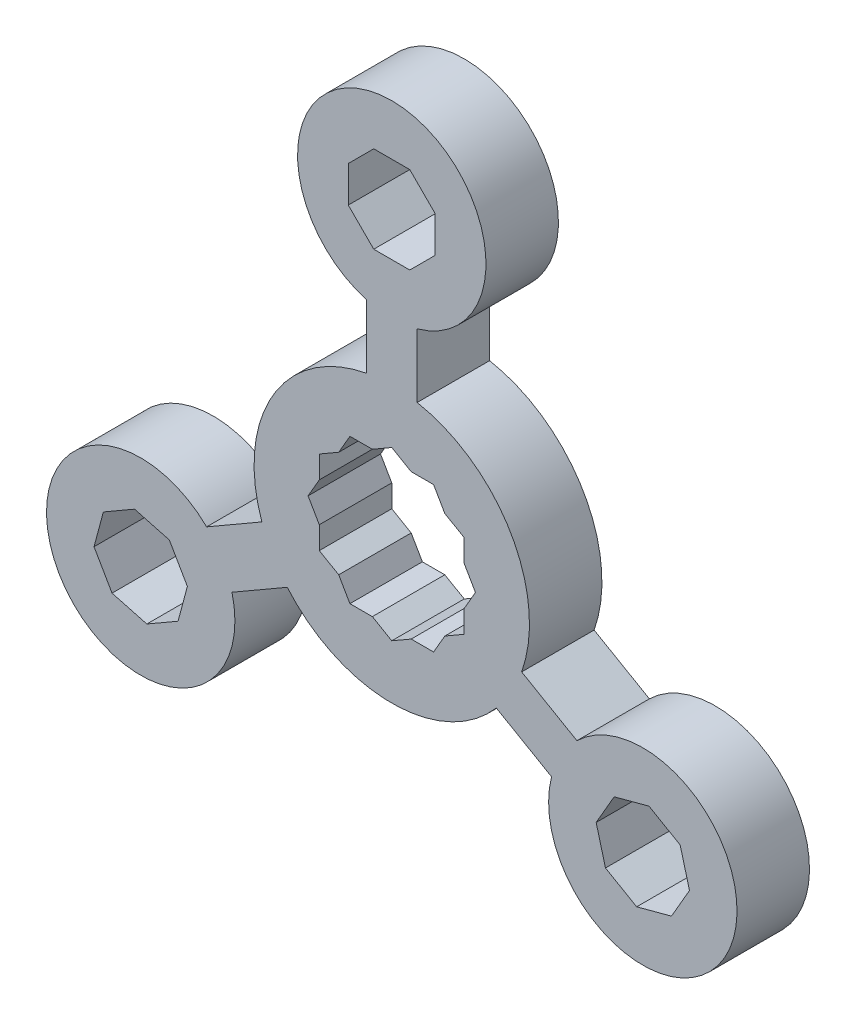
ISO-10303-21;
HEADER;
FILE_DESCRIPTION(('STEP AP214'),'2;1');
FILE_NAME('part.step','',(''),(''),'','','');
FILE_SCHEMA(('AUTOMOTIVE_DESIGN { 1 0 10303 214 1 1 1 1 }'));
ENDSEC;
DATA;
#1=APPLICATION_CONTEXT('core data for automotive mechanical design processes');
#2=APPLICATION_PROTOCOL_DEFINITION('international standard','automotive_design',2000,#1);
#3=PRODUCT_CONTEXT('',#1,'mechanical');
#4=PRODUCT('Part','Part','',(#3));
#5=PRODUCT_RELATED_PRODUCT_CATEGORY('part','',(#4));
#6=PRODUCT_DEFINITION_FORMATION('','',#4);
#7=PRODUCT_DEFINITION_CONTEXT('part definition',#1,'design');
#8=PRODUCT_DEFINITION('design','',#6,#7);
#9=PRODUCT_DEFINITION_SHAPE('','',#8);
#10=(LENGTH_UNIT() NAMED_UNIT(*) SI_UNIT(.MILLI.,.METRE.));
#11=(NAMED_UNIT(*) PLANE_ANGLE_UNIT() SI_UNIT($,.RADIAN.));
#12=(NAMED_UNIT(*) SI_UNIT($,.STERADIAN.) SOLID_ANGLE_UNIT());
#13=UNCERTAINTY_MEASURE_WITH_UNIT(LENGTH_MEASURE(1.E-05),#10,'distance_accuracy_value','');
#14=(GEOMETRIC_REPRESENTATION_CONTEXT(3) GLOBAL_UNCERTAINTY_ASSIGNED_CONTEXT((#13)) GLOBAL_UNIT_ASSIGNED_CONTEXT((#10,
#11,#12)) REPRESENTATION_CONTEXT('',''));
#15=CARTESIAN_POINT('',(0.,0.,0.));
#16=DIRECTION('',(0.,0.,1.));
#17=DIRECTION('',(1.,0.,0.));
#18=AXIS2_PLACEMENT_3D('',#15,#16,#17);
#19=CARTESIAN_POINT('',(-3.49999999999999,0.,10.));
#20=DIRECTION('',(1.,0.,0.));
#21=DIRECTION('',(0.,1.,0.));
#22=AXIS2_PLACEMENT_3D('',#19,#20,#21);
#23=PLANE('',#22);
#24=DIRECTION('',(0.,-1.,0.));
#25=VECTOR('',#24,1.);
#26=CARTESIAN_POINT('',(-3.49999999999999,0.,0.));
#27=LINE('',#26,#25);
#28=CARTESIAN_POINT('',(-3.5,27.4800159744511,0.));
#29=VERTEX_POINT('',#28);
#30=CARTESIAN_POINT('',(-3.5,18.6748493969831,0.));
#31=VERTEX_POINT('',#30);
#32=EDGE_CURVE('E563',#29,#31,#27,.T.);
#33=ORIENTED_EDGE('',*,*,#32,.T.);
#34=DIRECTION('',(0.,0.,-1.));
#35=VECTOR('',#34,1.);
#36=CARTESIAN_POINT('',(-3.5,18.6748493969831,10.));
#37=LINE('',#36,#35);
#38=CARTESIAN_POINT('',(-3.5,18.6748493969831,10.));
#39=VERTEX_POINT('',#38);
#40=EDGE_CURVE('E11',#39,#31,#37,.T.);
#41=ORIENTED_EDGE('',*,*,#40,.F.);
#42=DIRECTION('',(0.,-1.,0.));
#43=VECTOR('',#42,1.);
#44=CARTESIAN_POINT('',(-3.49999999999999,0.,10.));
#45=LINE('',#44,#43);
#46=CARTESIAN_POINT('',(-3.5,27.4800159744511,10.));
#47=VERTEX_POINT('',#46);
#48=EDGE_CURVE('E885',#47,#39,#45,.T.);
#49=ORIENTED_EDGE('',*,*,#48,.F.);
#50=DIRECTION('',(0.,0.,-1.));
#51=VECTOR('',#50,1.);
#52=CARTESIAN_POINT('',(-3.5,27.4800159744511,10.));
#53=LINE('',#52,#51);
#54=EDGE_CURVE('E592',#47,#29,#53,.T.);
#55=ORIENTED_EDGE('',*,*,#54,.T.);
#56=EDGE_LOOP('',(#33,#41,#49,#55));
#57=FACE_BOUND('',#56,.T.);
#58=ADVANCED_FACE('F32',(#57),#23,.F.);
#59=CARTESIAN_POINT('',(0.,0.,10.));
#60=DIRECTION('',(0.,0.,-1.));
#61=DIRECTION('',(-1.,0.,0.));
#62=AXIS2_PLACEMENT_3D('',#59,#60,#61);
#63=CYLINDRICAL_SURFACE('',#62,19.);
#64=CARTESIAN_POINT('',(0.,0.,0.));
#65=DIRECTION('',(0.,0.,1.));
#66=DIRECTION('',(1.,0.,0.));
#67=AXIS2_PLACEMENT_3D('',#64,#65,#66);
#68=CIRCLE('',#67,19.);
#69=CARTESIAN_POINT('',(-17.9228939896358,-6.30633578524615,0.));
#70=VERTEX_POINT('',#69);
#71=EDGE_CURVE('E566',#31,#70,#68,.T.);
#72=ORIENTED_EDGE('',*,*,#71,.T.);
#73=DIRECTION('',(0.,0.,-1.));
#74=VECTOR('',#73,1.);
#75=CARTESIAN_POINT('',(-17.9228939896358,-6.30633578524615,10.));
#76=LINE('',#75,#74);
#77=CARTESIAN_POINT('',(-17.9228939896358,-6.30633578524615,10.));
#78=VERTEX_POINT('',#77);
#79=EDGE_CURVE('E42',#78,#70,#76,.T.);
#80=ORIENTED_EDGE('',*,*,#79,.F.);
#81=CARTESIAN_POINT('',(0.,0.,10.));
#82=DIRECTION('',(0.,0.,1.));
#83=DIRECTION('',(1.,0.,0.));
#84=AXIS2_PLACEMENT_3D('',#81,#82,#83);
#85=CIRCLE('',#84,19.);
#86=EDGE_CURVE('E887',#39,#78,#85,.T.);
#87=ORIENTED_EDGE('',*,*,#86,.F.);
#88=ORIENTED_EDGE('',*,*,#40,.T.);
#89=EDGE_LOOP('',(#72,#80,#87,#88));
#90=FACE_BOUND('',#89,.T.);
#91=ADVANCED_FACE('F926',(#90),#63,.T.);
#92=CARTESIAN_POINT('',(-1.74999999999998,3.03108891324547,10.));
#93=DIRECTION('',(-0.500000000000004,0.866025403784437,0.));
#94=DIRECTION('',(-0.866025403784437,-0.500000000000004,0.));
#95=AXIS2_PLACEMENT_3D('',#92,#93,#94);
#96=PLANE('',#95);
#97=DIRECTION('',(0.866025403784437,0.500000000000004,0.));
#98=VECTOR('',#97,1.);
#99=CARTESIAN_POINT('',(-1.74999999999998,3.03108891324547,0.));
#100=LINE('',#99,#98);
#101=CARTESIAN_POINT('',(-25.5483919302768,-10.7089190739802,0.));
#102=VERTEX_POINT('',#101);
#103=EDGE_CURVE('E569',#102,#70,#100,.T.);
#104=ORIENTED_EDGE('',*,*,#103,.F.);
#105=DIRECTION('',(0.,0.,-1.));
#106=VECTOR('',#105,1.);
#107=CARTESIAN_POINT('',(-25.5483919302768,-10.7089190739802,10.));
#108=LINE('',#107,#106);
#109=CARTESIAN_POINT('',(-25.5483919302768,-10.7089190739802,10.));
#110=VERTEX_POINT('',#109);
#111=EDGE_CURVE('E609',#110,#102,#108,.T.);
#112=ORIENTED_EDGE('',*,*,#111,.F.);
#113=DIRECTION('',(0.866025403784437,0.500000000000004,0.));
#114=VECTOR('',#113,1.);
#115=CARTESIAN_POINT('',(-1.74999999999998,3.03108891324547,10.));
#116=LINE('',#115,#114);
#117=EDGE_CURVE('E889',#110,#78,#116,.T.);
#118=ORIENTED_EDGE('',*,*,#117,.T.);
#119=ORIENTED_EDGE('',*,*,#79,.T.);
#120=EDGE_LOOP('',(#104,#112,#118,#119));
#121=FACE_BOUND('',#120,.T.);
#122=ADVANCED_FACE('F931',(#121),#96,.T.);
#123=CARTESIAN_POINT('',(-34.6410161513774,-20.0000000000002,10.));
#124=DIRECTION('',(0.,0.,-1.));
#125=DIRECTION('',(-1.,0.,0.));
#126=AXIS2_PLACEMENT_3D('',#123,#124,#125);
#127=CYLINDRICAL_SURFACE('',#126,13.);
#128=CARTESIAN_POINT('',(-34.6410161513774,-20.0000000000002,0.));
#129=DIRECTION('',(0.,0.,1.));
#130=DIRECTION('',(1.,0.,0.));
#131=AXIS2_PLACEMENT_3D('',#128,#129,#130);
#132=CIRCLE('',#131,13.);
#133=CARTESIAN_POINT('',(-22.0483919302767,-16.7710969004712,0.));
#134=VERTEX_POINT('',#133);
#135=EDGE_CURVE('E572',#102,#134,#132,.T.);
#136=ORIENTED_EDGE('',*,*,#135,.T.);
#137=DIRECTION('',(0.,0.,-1.));
#138=VECTOR('',#137,1.);
#139=CARTESIAN_POINT('',(-22.0483919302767,-16.7710969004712,10.));
#140=LINE('',#139,#138);
#141=CARTESIAN_POINT('',(-22.0483919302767,-16.7710969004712,10.));
#142=VERTEX_POINT('',#141);
#143=EDGE_CURVE('E607',#142,#134,#140,.T.);
#144=ORIENTED_EDGE('',*,*,#143,.F.);
#145=CARTESIAN_POINT('',(-34.6410161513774,-20.0000000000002,10.));
#146=DIRECTION('',(0.,0.,1.));
#147=DIRECTION('',(1.,0.,0.));
#148=AXIS2_PLACEMENT_3D('',#145,#146,#147);
#149=CIRCLE('',#148,13.);
#150=EDGE_CURVE('E892',#110,#142,#149,.T.);
#151=ORIENTED_EDGE('',*,*,#150,.F.);
#152=ORIENTED_EDGE('',*,*,#111,.T.);
#153=EDGE_LOOP('',(#136,#144,#151,#152));
#154=FACE_BOUND('',#153,.T.);
#155=ADVANCED_FACE('F1221',(#154),#127,.T.);
#156=CARTESIAN_POINT('',(1.74999999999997,-3.03108891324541,10.));
#157=DIRECTION('',(0.500000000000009,-0.866025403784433,0.));
#158=DIRECTION('',(0.866025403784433,0.500000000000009,0.));
#159=AXIS2_PLACEMENT_3D('',#156,#157,#158);
#160=PLANE('',#159);
#161=DIRECTION('',(-0.866025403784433,-0.500000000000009,0.));
#162=VECTOR('',#161,1.);
#163=CARTESIAN_POINT('',(1.74999999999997,-3.03108891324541,0.));
#164=LINE('',#163,#162);
#165=CARTESIAN_POINT('',(-14.4228939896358,-12.3685136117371,0.));
#166=VERTEX_POINT('',#165);
#167=EDGE_CURVE('E575',#166,#134,#164,.T.);
#168=ORIENTED_EDGE('',*,*,#167,.F.);
#169=DIRECTION('',(0.,0.,-1.));
#170=VECTOR('',#169,1.);
#171=CARTESIAN_POINT('',(-14.4228939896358,-12.3685136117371,10.));
#172=LINE('',#171,#170);
#173=CARTESIAN_POINT('',(-14.4228939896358,-12.3685136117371,10.));
#174=VERTEX_POINT('',#173);
#175=EDGE_CURVE('E605',#174,#166,#172,.T.);
#176=ORIENTED_EDGE('',*,*,#175,.F.);
#177=DIRECTION('',(-0.866025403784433,-0.500000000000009,0.));
#178=VECTOR('',#177,1.);
#179=CARTESIAN_POINT('',(1.74999999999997,-3.03108891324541,10.));
#180=LINE('',#179,#178);
#181=EDGE_CURVE('E894',#174,#142,#180,.T.);
#182=ORIENTED_EDGE('',*,*,#181,.T.);
#183=ORIENTED_EDGE('',*,*,#143,.T.);
#184=EDGE_LOOP('',(#168,#176,#182,#183));
#185=FACE_BOUND('',#184,.T.);
#186=ADVANCED_FACE('F1213',(#185),#160,.T.);
#187=CARTESIAN_POINT('',(0.,0.,10.));
#188=DIRECTION('',(0.,0.,-1.));
#189=DIRECTION('',(-1.,0.,0.));
#190=AXIS2_PLACEMENT_3D('',#187,#188,#189);
#191=CYLINDRICAL_SURFACE('',#190,19.);
#192=CARTESIAN_POINT('',(0.,0.,0.));
#193=DIRECTION('',(0.,0.,1.));
#194=DIRECTION('',(1.,0.,0.));
#195=AXIS2_PLACEMENT_3D('',#192,#193,#194);
#196=CIRCLE('',#195,19.);
#197=CARTESIAN_POINT('',(14.4228939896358,-12.3685136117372,0.));
#198=VERTEX_POINT('',#197);
#199=EDGE_CURVE('E578',#166,#198,#196,.T.);
#200=ORIENTED_EDGE('',*,*,#199,.T.);
#201=DIRECTION('',(0.,0.,-1.));
#202=VECTOR('',#201,1.);
#203=CARTESIAN_POINT('',(14.4228939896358,-12.3685136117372,10.));
#204=LINE('',#203,#202);
#205=CARTESIAN_POINT('',(14.4228939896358,-12.3685136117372,10.));
#206=VERTEX_POINT('',#205);
#207=EDGE_CURVE('E602',#206,#198,#204,.T.);
#208=ORIENTED_EDGE('',*,*,#207,.F.);
#209=CARTESIAN_POINT('',(0.,0.,10.));
#210=DIRECTION('',(0.,0.,1.));
#211=DIRECTION('',(1.,0.,0.));
#212=AXIS2_PLACEMENT_3D('',#209,#210,#211);
#213=CIRCLE('',#212,19.);
#214=EDGE_CURVE('E897',#174,#206,#213,.T.);
#215=ORIENTED_EDGE('',*,*,#214,.F.);
#216=ORIENTED_EDGE('',*,*,#175,.T.);
#217=EDGE_LOOP('',(#200,#208,#215,#216));
#218=FACE_BOUND('',#217,.T.);
#219=ADVANCED_FACE('F1205',(#218),#191,.T.);
#220=CARTESIAN_POINT('',(-1.75000000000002,-3.03108891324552,10.));
#221=DIRECTION('',(0.500000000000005,0.866025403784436,0.));
#222=DIRECTION('',(-0.866025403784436,0.500000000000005,0.));
#223=AXIS2_PLACEMENT_3D('',#220,#221,#222);
#224=PLANE('',#223);
#225=DIRECTION('',(0.866025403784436,-0.500000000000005,0.));
#226=VECTOR('',#225,1.);
#227=CARTESIAN_POINT('',(-1.75000000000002,-3.03108891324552,0.));
#228=LINE('',#227,#226);
#229=CARTESIAN_POINT('',(22.0483919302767,-16.7710969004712,0.));
#230=VERTEX_POINT('',#229);
#231=EDGE_CURVE('E580',#198,#230,#228,.T.);
#232=ORIENTED_EDGE('',*,*,#231,.T.);
#233=DIRECTION('',(0.,0.,-1.));
#234=VECTOR('',#233,1.);
#235=CARTESIAN_POINT('',(22.0483919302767,-16.7710969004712,10.));
#236=LINE('',#235,#234);
#237=CARTESIAN_POINT('',(22.0483919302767,-16.7710969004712,10.));
#238=VERTEX_POINT('',#237);
#239=EDGE_CURVE('E599',#238,#230,#236,.T.);
#240=ORIENTED_EDGE('',*,*,#239,.F.);
#241=DIRECTION('',(0.866025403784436,-0.500000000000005,0.));
#242=VECTOR('',#241,1.);
#243=CARTESIAN_POINT('',(-1.75000000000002,-3.03108891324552,10.));
#244=LINE('',#243,#242);
#245=EDGE_CURVE('E899',#206,#238,#244,.T.);
#246=ORIENTED_EDGE('',*,*,#245,.F.);
#247=ORIENTED_EDGE('',*,*,#207,.T.);
#248=EDGE_LOOP('',(#232,#240,#246,#247));
#249=FACE_BOUND('',#248,.T.);
#250=ADVANCED_FACE('F1197',(#249),#224,.F.);
#251=CARTESIAN_POINT('',(34.6410161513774,-20.0000000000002,10.));
#252=DIRECTION('',(0.,0.,-1.));
#253=DIRECTION('',(-1.,0.,0.));
#254=AXIS2_PLACEMENT_3D('',#251,#252,#253);
#255=CYLINDRICAL_SURFACE('',#254,13.);
#256=CARTESIAN_POINT('',(34.6410161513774,-20.0000000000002,0.));
#257=DIRECTION('',(0.,0.,1.));
#258=DIRECTION('',(1.,0.,0.));
#259=AXIS2_PLACEMENT_3D('',#256,#257,#258);
#260=CIRCLE('',#259,13.);
#261=CARTESIAN_POINT('',(25.5483919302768,-10.7089190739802,0.));
#262=VERTEX_POINT('',#261);
#263=EDGE_CURVE('E582',#230,#262,#260,.T.);
#264=ORIENTED_EDGE('',*,*,#263,.T.);
#265=DIRECTION('',(0.,0.,-1.));
#266=VECTOR('',#265,1.);
#267=CARTESIAN_POINT('',(25.5483919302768,-10.7089190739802,10.));
#268=LINE('',#267,#266);
#269=CARTESIAN_POINT('',(25.5483919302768,-10.7089190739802,10.));
#270=VERTEX_POINT('',#269);
#271=EDGE_CURVE('E597',#270,#262,#268,.T.);
#272=ORIENTED_EDGE('',*,*,#271,.F.);
#273=CARTESIAN_POINT('',(34.6410161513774,-20.0000000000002,10.));
#274=DIRECTION('',(0.,0.,1.));
#275=DIRECTION('',(1.,0.,0.));
#276=AXIS2_PLACEMENT_3D('',#273,#274,#275);
#277=CIRCLE('',#276,13.);
#278=EDGE_CURVE('E901',#238,#270,#277,.T.);
#279=ORIENTED_EDGE('',*,*,#278,.F.);
#280=ORIENTED_EDGE('',*,*,#239,.T.);
#281=EDGE_LOOP('',(#264,#272,#279,#280));
#282=FACE_BOUND('',#281,.T.);
#283=ADVANCED_FACE('F1190',(#282),#255,.T.);
#284=CARTESIAN_POINT('',(1.75000000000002,3.03108891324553,10.));
#285=DIRECTION('',(0.500000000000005,0.866025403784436,0.));
#286=DIRECTION('',(-0.866025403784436,0.500000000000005,0.));
#287=AXIS2_PLACEMENT_3D('',#284,#285,#286);
#288=PLANE('',#287);
#289=DIRECTION('',(0.866025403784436,-0.500000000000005,0.));
#290=VECTOR('',#289,1.);
#291=CARTESIAN_POINT('',(1.75000000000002,3.03108891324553,0.));
#292=LINE('',#291,#290);
#293=CARTESIAN_POINT('',(17.9228939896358,-6.30633578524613,0.));
#294=VERTEX_POINT('',#293);
#295=EDGE_CURVE('E585',#294,#262,#292,.T.);
#296=ORIENTED_EDGE('',*,*,#295,.F.);
#297=DIRECTION('',(0.,0.,-1.));
#298=VECTOR('',#297,1.);
#299=CARTESIAN_POINT('',(17.9228939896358,-6.30633578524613,10.));
#300=LINE('',#299,#298);
#301=CARTESIAN_POINT('',(17.9228939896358,-6.30633578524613,10.));
#302=VERTEX_POINT('',#301);
#303=EDGE_CURVE('E434',#302,#294,#300,.T.);
#304=ORIENTED_EDGE('',*,*,#303,.F.);
#305=DIRECTION('',(0.866025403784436,-0.500000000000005,0.));
#306=VECTOR('',#305,1.);
#307=CARTESIAN_POINT('',(1.75000000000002,3.03108891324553,10.));
#308=LINE('',#307,#306);
#309=EDGE_CURVE('E427',#302,#270,#308,.T.);
#310=ORIENTED_EDGE('',*,*,#309,.T.);
#311=ORIENTED_EDGE('',*,*,#271,.T.);
#312=EDGE_LOOP('',(#296,#304,#310,#311));
#313=FACE_BOUND('',#312,.T.);
#314=ADVANCED_FACE('F904',(#313),#288,.T.);
#315=CARTESIAN_POINT('',(0.,0.,10.));
#316=DIRECTION('',(0.,0.,-1.));
#317=DIRECTION('',(-1.,0.,0.));
#318=AXIS2_PLACEMENT_3D('',#315,#316,#317);
#319=CYLINDRICAL_SURFACE('',#318,19.);
#320=CARTESIAN_POINT('',(0.,0.,0.));
#321=DIRECTION('',(0.,0.,1.));
#322=DIRECTION('',(1.,0.,0.));
#323=AXIS2_PLACEMENT_3D('',#320,#321,#322);
#324=CIRCLE('',#323,19.);
#325=CARTESIAN_POINT('',(3.5,18.6748493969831,0.));
#326=VERTEX_POINT('',#325);
#327=EDGE_CURVE('E433',#294,#326,#324,.T.);
#328=ORIENTED_EDGE('',*,*,#327,.T.);
#329=DIRECTION('',(0.,0.,-1.));
#330=VECTOR('',#329,1.);
#331=CARTESIAN_POINT('',(3.5,18.6748493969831,10.));
#332=LINE('',#331,#330);
#333=CARTESIAN_POINT('',(3.5,18.6748493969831,10.));
#334=VERTEX_POINT('',#333);
#335=EDGE_CURVE('E430',#334,#326,#332,.T.);
#336=ORIENTED_EDGE('',*,*,#335,.F.);
#337=CARTESIAN_POINT('',(0.,0.,10.));
#338=DIRECTION('',(0.,0.,1.));
#339=DIRECTION('',(1.,0.,0.));
#340=AXIS2_PLACEMENT_3D('',#337,#338,#339);
#341=CIRCLE('',#340,19.);
#342=EDGE_CURVE('E421',#302,#334,#341,.T.);
#343=ORIENTED_EDGE('',*,*,#342,.F.);
#344=ORIENTED_EDGE('',*,*,#303,.T.);
#345=EDGE_LOOP('',(#328,#336,#343,#344));
#346=FACE_BOUND('',#345,.T.);
#347=ADVANCED_FACE('F431',(#346),#319,.T.);
#348=CARTESIAN_POINT('',(3.50000000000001,0.,10.));
#349=DIRECTION('',(-1.,0.,0.));
#350=DIRECTION('',(0.,-1.,0.));
#351=AXIS2_PLACEMENT_3D('',#348,#349,#350);
#352=PLANE('',#351);
#353=DIRECTION('',(0.,1.,0.));
#354=VECTOR('',#353,1.);
#355=CARTESIAN_POINT('',(3.50000000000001,0.,0.));
#356=LINE('',#355,#354);
#357=CARTESIAN_POINT('',(3.5,27.4800159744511,0.));
#358=VERTEX_POINT('',#357);
#359=EDGE_CURVE('E236',#326,#358,#356,.T.);
#360=ORIENTED_EDGE('',*,*,#359,.T.);
#361=DIRECTION('',(0.,0.,-1.));
#362=VECTOR('',#361,1.);
#363=CARTESIAN_POINT('',(3.5,27.4800159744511,10.));
#364=LINE('',#363,#362);
#365=CARTESIAN_POINT('',(3.5,27.4800159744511,10.));
#366=VERTEX_POINT('',#365);
#367=EDGE_CURVE('E435',#366,#358,#364,.T.);
#368=ORIENTED_EDGE('',*,*,#367,.F.);
#369=DIRECTION('',(0.,1.,0.));
#370=VECTOR('',#369,1.);
#371=CARTESIAN_POINT('',(3.50000000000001,0.,10.));
#372=LINE('',#371,#370);
#373=EDGE_CURVE('E425',#334,#366,#372,.T.);
#374=ORIENTED_EDGE('',*,*,#373,.F.);
#375=ORIENTED_EDGE('',*,*,#335,.T.);
#376=EDGE_LOOP('',(#360,#368,#374,#375));
#377=FACE_BOUND('',#376,.T.);
#378=ADVANCED_FACE('F437',(#377),#352,.F.);
#379=CARTESIAN_POINT('',(3.00000000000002,5.1961524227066,10.));
#380=DIRECTION('',(-0.500000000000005,-0.866025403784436,0.));
#381=DIRECTION('',(0.866025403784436,-0.500000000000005,0.));
#382=AXIS2_PLACEMENT_3D('',#379,#380,#381);
#383=PLANE('',#382);
#384=DIRECTION('',(-0.866025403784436,0.500000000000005,0.));
#385=VECTOR('',#384,1.);
#386=CARTESIAN_POINT('',(3.00000000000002,5.1961524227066,0.));
#387=LINE('',#386,#385);
#388=CARTESIAN_POINT('',(39.7933329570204,-16.0464882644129,0.));
#389=VERTEX_POINT('',#388);
#390=CARTESIAN_POINT('',(35.4886993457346,-13.5612068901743,0.));
#391=VERTEX_POINT('',#390);
#392=EDGE_CURVE('E539',#389,#391,#387,.T.);
#393=ORIENTED_EDGE('',*,*,#392,.F.);
#394=DIRECTION('',(0.,0.,-1.));
#395=VECTOR('',#394,1.);
#396=CARTESIAN_POINT('',(39.7933329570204,-16.0464882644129,10.));
#397=LINE('',#396,#395);
#398=CARTESIAN_POINT('',(39.7933329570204,-16.0464882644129,10.));
#399=VERTEX_POINT('',#398);
#400=EDGE_CURVE('E594',#399,#389,#397,.T.);
#401=ORIENTED_EDGE('',*,*,#400,.F.);
#402=DIRECTION('',(-0.866025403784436,0.500000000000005,0.));
#403=VECTOR('',#402,1.);
#404=CARTESIAN_POINT('',(3.00000000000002,5.1961524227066,10.));
#405=LINE('',#404,#403);
#406=CARTESIAN_POINT('',(35.4886993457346,-13.5612068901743,10.));
#407=VERTEX_POINT('',#406);
#408=EDGE_CURVE('E861',#399,#407,#405,.T.);
#409=ORIENTED_EDGE('',*,*,#408,.T.);
#410=DIRECTION('',(0.,0.,-1.));
#411=VECTOR('',#410,1.);
#412=CARTESIAN_POINT('',(35.4886993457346,-13.5612068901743,10.));
#413=LINE('',#412,#411);
#414=EDGE_CURVE('E612',#407,#391,#413,.T.);
#415=ORIENTED_EDGE('',*,*,#414,.T.);
#416=EDGE_LOOP('',(#393,#401,#409,#415));
#417=FACE_BOUND('',#416,.T.);
#418=ADVANCED_FACE('F966',(#417),#383,.T.);
#419=CARTESIAN_POINT('',(33.1160630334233,8.87342234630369,10.));
#420=DIRECTION('',(-0.96592582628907,-0.258819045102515,0.));
#421=DIRECTION('',(0.258819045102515,-0.96592582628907,0.));
#422=AXIS2_PLACEMENT_3D('',#419,#420,#421);
#423=PLANE('',#422);
#424=DIRECTION('',(-0.258819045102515,0.96592582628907,0.));
#425=VECTOR('',#424,1.);
#426=CARTESIAN_POINT('',(33.1160630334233,8.87342234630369,0.));
#427=LINE('',#426,#425);
#428=CARTESIAN_POINT('',(41.0798092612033,-20.8476831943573,0.));
#429=VERTEX_POINT('',#428);
#430=EDGE_CURVE('E542',#429,#389,#427,.T.);
#431=ORIENTED_EDGE('',*,*,#430,.F.);
#432=DIRECTION('',(0.,0.,-1.));
#433=VECTOR('',#432,1.);
#434=CARTESIAN_POINT('',(41.0798092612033,-20.8476831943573,10.));
#435=LINE('',#434,#433);
#436=CARTESIAN_POINT('',(41.0798092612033,-20.8476831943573,10.));
#437=VERTEX_POINT('',#436);
#438=EDGE_CURVE('E625',#437,#429,#435,.T.);
#439=ORIENTED_EDGE('',*,*,#438,.F.);
#440=DIRECTION('',(-0.258819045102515,0.96592582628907,0.));
#441=VECTOR('',#440,1.);
#442=CARTESIAN_POINT('',(33.1160630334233,8.87342234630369,10.));
#443=LINE('',#442,#441);
#444=EDGE_CURVE('E864',#437,#399,#443,.T.);
#445=ORIENTED_EDGE('',*,*,#444,.T.);
#446=ORIENTED_EDGE('',*,*,#400,.T.);
#447=EDGE_LOOP('',(#431,#439,#445,#446));
#448=FACE_BOUND('',#447,.T.);
#449=ADVANCED_FACE('F962',(#448),#423,.T.);
#450=CARTESIAN_POINT('',(39.8371685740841,-23.0000000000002,10.));
#451=DIRECTION('',(-0.866025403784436,0.500000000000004,0.));
#452=DIRECTION('',(-0.500000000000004,-0.866025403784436,0.));
#453=AXIS2_PLACEMENT_3D('',#450,#451,#452);
#454=PLANE('',#453);
#455=DIRECTION('',(0.500000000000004,0.866025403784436,0.));
#456=VECTOR('',#455,1.);
#457=CARTESIAN_POINT('',(39.8371685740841,-23.0000000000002,0.));
#458=LINE('',#457,#456);
#459=CARTESIAN_POINT('',(38.5945278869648,-25.1523168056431,0.));
#460=VERTEX_POINT('',#459);
#461=EDGE_CURVE('E545',#460,#429,#458,.T.);
#462=ORIENTED_EDGE('',*,*,#461,.F.);
#463=DIRECTION('',(0.,0.,-1.));
#464=VECTOR('',#463,1.);
#465=CARTESIAN_POINT('',(38.5945278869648,-25.1523168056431,10.));
#466=LINE('',#465,#464);
#467=CARTESIAN_POINT('',(38.5945278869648,-25.1523168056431,10.));
#468=VERTEX_POINT('',#467);
#469=EDGE_CURVE('E623',#468,#460,#466,.T.);
#470=ORIENTED_EDGE('',*,*,#469,.F.);
#471=DIRECTION('',(0.500000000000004,0.866025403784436,0.));
#472=VECTOR('',#471,1.);
#473=CARTESIAN_POINT('',(39.8371685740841,-23.0000000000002,10.));
#474=LINE('',#473,#472);
#475=EDGE_CURVE('E867',#468,#437,#474,.T.);
#476=ORIENTED_EDGE('',*,*,#475,.T.);
#477=ORIENTED_EDGE('',*,*,#438,.T.);
#478=EDGE_LOOP('',(#462,#470,#476,#477));
#479=FACE_BOUND('',#478,.T.);
#480=ADVANCED_FACE('F958',(#479),#454,.T.);
#481=CARTESIAN_POINT('',(8.87342234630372,-33.1160630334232,10.));
#482=DIRECTION('',(-0.258819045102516,0.96592582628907,0.));
#483=DIRECTION('',(-0.96592582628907,-0.258819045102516,0.));
#484=AXIS2_PLACEMENT_3D('',#481,#482,#483);
#485=PLANE('',#484);
#486=DIRECTION('',(0.96592582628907,0.258819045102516,0.));
#487=VECTOR('',#486,1.);
#488=CARTESIAN_POINT('',(8.87342234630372,-33.1160630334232,0.));
#489=LINE('',#488,#487);
#490=CARTESIAN_POINT('',(33.7933329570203,-26.4387931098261,0.));
#491=VERTEX_POINT('',#490);
#492=EDGE_CURVE('E548',#491,#460,#489,.T.);
#493=ORIENTED_EDGE('',*,*,#492,.F.);
#494=DIRECTION('',(0.,0.,-1.));
#495=VECTOR('',#494,1.);
#496=CARTESIAN_POINT('',(33.7933329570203,-26.4387931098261,10.));
#497=LINE('',#496,#495);
#498=CARTESIAN_POINT('',(33.7933329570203,-26.4387931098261,10.));
#499=VERTEX_POINT('',#498);
#500=EDGE_CURVE('E621',#499,#491,#497,.T.);
#501=ORIENTED_EDGE('',*,*,#500,.F.);
#502=DIRECTION('',(0.96592582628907,0.258819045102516,0.));
#503=VECTOR('',#502,1.);
#504=CARTESIAN_POINT('',(8.87342234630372,-33.1160630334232,10.));
#505=LINE('',#504,#503);
#506=EDGE_CURVE('E870',#499,#468,#505,.T.);
#507=ORIENTED_EDGE('',*,*,#506,.T.);
#508=ORIENTED_EDGE('',*,*,#469,.T.);
#509=EDGE_LOOP('',(#493,#501,#507,#508));
#510=FACE_BOUND('',#509,.T.);
#511=ADVANCED_FACE('F954',(#510),#485,.T.);
#512=CARTESIAN_POINT('',(-3.00000000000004,-5.19615242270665,10.));
#513=DIRECTION('',(0.500000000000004,0.866025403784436,0.));
#514=DIRECTION('',(-0.866025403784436,0.500000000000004,0.));
#515=AXIS2_PLACEMENT_3D('',#512,#513,#514);
#516=PLANE('',#515);
#517=DIRECTION('',(0.866025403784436,-0.500000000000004,0.));
#518=VECTOR('',#517,1.);
#519=CARTESIAN_POINT('',(-3.00000000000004,-5.19615242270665,0.));
#520=LINE('',#519,#518);
#521=CARTESIAN_POINT('',(29.4886993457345,-23.9535117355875,0.));
#522=VERTEX_POINT('',#521);
#523=EDGE_CURVE('E551',#522,#491,#520,.T.);
#524=ORIENTED_EDGE('',*,*,#523,.F.);
#525=DIRECTION('',(0.,0.,-1.));
#526=VECTOR('',#525,1.);
#527=CARTESIAN_POINT('',(29.4886993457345,-23.9535117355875,10.));
#528=LINE('',#527,#526);
#529=CARTESIAN_POINT('',(29.4886993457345,-23.9535117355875,10.));
#530=VERTEX_POINT('',#529);
#531=EDGE_CURVE('E619',#530,#522,#528,.T.);
#532=ORIENTED_EDGE('',*,*,#531,.F.);
#533=DIRECTION('',(0.866025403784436,-0.500000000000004,0.));
#534=VECTOR('',#533,1.);
#535=CARTESIAN_POINT('',(-3.00000000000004,-5.19615242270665,10.));
#536=LINE('',#535,#534);
#537=EDGE_CURVE('E873',#530,#499,#536,.T.);
#538=ORIENTED_EDGE('',*,*,#537,.T.);
#539=ORIENTED_EDGE('',*,*,#500,.T.);
#540=EDGE_LOOP('',(#524,#532,#538,#539));
#541=FACE_BOUND('',#540,.T.);
#542=ADVANCED_FACE('F950',(#541),#516,.T.);
#543=CARTESIAN_POINT('',(21.5249531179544,5.76759380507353,10.));
#544=DIRECTION('',(0.96592582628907,0.258819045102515,0.));
#545=DIRECTION('',(-0.258819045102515,0.96592582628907,0.));
#546=AXIS2_PLACEMENT_3D('',#543,#544,#545);
#547=PLANE('',#546);
#548=DIRECTION('',(0.258819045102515,-0.96592582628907,0.));
#549=VECTOR('',#548,1.);
#550=CARTESIAN_POINT('',(21.5249531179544,5.76759380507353,0.));
#551=LINE('',#550,#549);
#552=CARTESIAN_POINT('',(28.2022230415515,-19.1523168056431,0.));
#553=VERTEX_POINT('',#552);
#554=EDGE_CURVE('E554',#553,#522,#551,.T.);
#555=ORIENTED_EDGE('',*,*,#554,.F.);
#556=DIRECTION('',(0.,0.,-1.));
#557=VECTOR('',#556,1.);
#558=CARTESIAN_POINT('',(28.2022230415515,-19.1523168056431,10.));
#559=LINE('',#558,#557);
#560=CARTESIAN_POINT('',(28.2022230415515,-19.1523168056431,10.));
#561=VERTEX_POINT('',#560);
#562=EDGE_CURVE('E617',#561,#553,#559,.T.);
#563=ORIENTED_EDGE('',*,*,#562,.F.);
#564=DIRECTION('',(0.258819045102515,-0.96592582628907,0.));
#565=VECTOR('',#564,1.);
#566=CARTESIAN_POINT('',(21.5249531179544,5.76759380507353,10.));
#567=LINE('',#566,#565);
#568=EDGE_CURVE('E876',#561,#530,#567,.T.);
#569=ORIENTED_EDGE('',*,*,#568,.T.);
#570=ORIENTED_EDGE('',*,*,#531,.T.);
#571=EDGE_LOOP('',(#555,#563,#569,#570));
#572=FACE_BOUND('',#571,.T.);
#573=ADVANCED_FACE('F946',(#572),#547,.T.);
#574=CARTESIAN_POINT('',(29.4448637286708,-17.0000000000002,10.));
#575=DIRECTION('',(0.866025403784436,-0.500000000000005,0.));
#576=DIRECTION('',(0.500000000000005,0.866025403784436,0.));
#577=AXIS2_PLACEMENT_3D('',#574,#575,#576);
#578=PLANE('',#577);
#579=DIRECTION('',(-0.500000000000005,-0.866025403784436,0.));
#580=VECTOR('',#579,1.);
#581=CARTESIAN_POINT('',(29.4448637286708,-17.0000000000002,0.));
#582=LINE('',#581,#580);
#583=CARTESIAN_POINT('',(30.6875044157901,-14.8476831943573,0.));
#584=VERTEX_POINT('',#583);
#585=EDGE_CURVE('E557',#584,#553,#582,.T.);
#586=ORIENTED_EDGE('',*,*,#585,.F.);
#587=DIRECTION('',(0.,0.,-1.));
#588=VECTOR('',#587,1.);
#589=CARTESIAN_POINT('',(30.6875044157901,-14.8476831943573,10.));
#590=LINE('',#589,#588);
#591=CARTESIAN_POINT('',(30.6875044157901,-14.8476831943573,10.));
#592=VERTEX_POINT('',#591);
#593=EDGE_CURVE('E614',#592,#584,#590,.T.);
#594=ORIENTED_EDGE('',*,*,#593,.F.);
#595=DIRECTION('',(-0.500000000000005,-0.866025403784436,0.));
#596=VECTOR('',#595,1.);
#597=CARTESIAN_POINT('',(29.4448637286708,-17.0000000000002,10.));
#598=LINE('',#597,#596);
#599=EDGE_CURVE('E879',#592,#561,#598,.T.);
#600=ORIENTED_EDGE('',*,*,#599,.T.);
#601=ORIENTED_EDGE('',*,*,#562,.T.);
#602=EDGE_LOOP('',(#586,#594,#600,#601));
#603=FACE_BOUND('',#602,.T.);
#604=ADVANCED_FACE('F942',(#603),#578,.T.);
#605=CARTESIAN_POINT('',(24.2426406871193,24.2426406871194,10.));
#606=DIRECTION('',(-0.707106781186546,-0.707106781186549,0.));
#607=DIRECTION('',(0.707106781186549,-0.707106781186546,0.));
#608=AXIS2_PLACEMENT_3D('',#605,#606,#607);
#609=PLANE('',#608);
#610=DIRECTION('',(-0.707106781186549,0.707106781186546,0.));
#611=VECTOR('',#610,1.);
#612=CARTESIAN_POINT('',(24.2426406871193,24.2426406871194,0.));
#613=LINE('',#612,#611);
#614=CARTESIAN_POINT('',(5.99999999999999,42.4852813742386,0.));
#615=VERTEX_POINT('',#614);
#616=CARTESIAN_POINT('',(2.48528137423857,46.,0.));
#617=VERTEX_POINT('',#616);
#618=EDGE_CURVE('E515',#615,#617,#613,.T.);
#619=ORIENTED_EDGE('',*,*,#618,.F.);
#620=DIRECTION('',(0.,0.,-1.));
#621=VECTOR('',#620,1.);
#622=CARTESIAN_POINT('',(5.99999999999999,42.4852813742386,10.));
#623=LINE('',#622,#621);
#624=CARTESIAN_POINT('',(5.99999999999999,42.4852813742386,10.));
#625=VERTEX_POINT('',#624);
#626=EDGE_CURVE('E615',#625,#615,#623,.T.);
#627=ORIENTED_EDGE('',*,*,#626,.F.);
#628=DIRECTION('',(-0.707106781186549,0.707106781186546,0.));
#629=VECTOR('',#628,1.);
#630=CARTESIAN_POINT('',(24.2426406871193,24.2426406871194,10.));
#631=LINE('',#630,#629);
#632=CARTESIAN_POINT('',(2.48528137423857,46.,10.));
#633=VERTEX_POINT('',#632);
#634=EDGE_CURVE('E837',#625,#633,#631,.T.);
#635=ORIENTED_EDGE('',*,*,#634,.T.);
#636=DIRECTION('',(0.,0.,-1.));
#637=VECTOR('',#636,1.);
#638=CARTESIAN_POINT('',(2.48528137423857,46.,10.));
#639=LINE('',#638,#637);
#640=EDGE_CURVE('E628',#633,#617,#639,.T.);
#641=ORIENTED_EDGE('',*,*,#640,.T.);
#642=EDGE_LOOP('',(#619,#627,#635,#641));
#643=FACE_BOUND('',#642,.T.);
#644=ADVANCED_FACE('F945',(#643),#609,.T.);
#645=CARTESIAN_POINT('',(5.99999999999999,0.,10.));
#646=DIRECTION('',(-1.,0.,0.));
#647=DIRECTION('',(0.,0.,1.));
#648=AXIS2_PLACEMENT_3D('',#645,#646,#647);
#649=PLANE('',#648);
#650=DIRECTION('',(0.,1.,0.));
#651=VECTOR('',#650,1.);
#652=CARTESIAN_POINT('',(5.99999999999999,0.,0.));
#653=LINE('',#652,#651);
#654=CARTESIAN_POINT('',(5.99999999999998,37.5147186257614,0.));
#655=VERTEX_POINT('',#654);
#656=EDGE_CURVE('E518',#655,#615,#653,.T.);
#657=ORIENTED_EDGE('',*,*,#656,.F.);
#658=DIRECTION('',(0.,0.,-1.));
#659=VECTOR('',#658,1.);
#660=CARTESIAN_POINT('',(5.99999999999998,37.5147186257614,10.));
#661=LINE('',#660,#659);
#662=CARTESIAN_POINT('',(5.99999999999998,37.5147186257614,10.));
#663=VERTEX_POINT('',#662);
#664=EDGE_CURVE('E641',#663,#655,#661,.T.);
#665=ORIENTED_EDGE('',*,*,#664,.F.);
#666=DIRECTION('',(0.,1.,0.));
#667=VECTOR('',#666,1.);
#668=CARTESIAN_POINT('',(5.99999999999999,0.,10.));
#669=LINE('',#668,#667);
#670=EDGE_CURVE('E840',#663,#625,#669,.T.);
#671=ORIENTED_EDGE('',*,*,#670,.T.);
#672=ORIENTED_EDGE('',*,*,#626,.T.);
#673=EDGE_LOOP('',(#657,#665,#671,#672));
#674=FACE_BOUND('',#673,.T.);
#675=ADVANCED_FACE('F994',(#674),#649,.T.);
#676=CARTESIAN_POINT('',(-15.7573593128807,15.7573593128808,10.));
#677=DIRECTION('',(-0.707106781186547,0.707106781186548,0.));
#678=DIRECTION('',(-0.707106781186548,-0.707106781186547,0.));
#679=AXIS2_PLACEMENT_3D('',#676,#677,#678);
#680=PLANE('',#679);
#681=DIRECTION('',(0.707106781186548,0.707106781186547,0.));
#682=VECTOR('',#681,1.);
#683=CARTESIAN_POINT('',(-15.7573593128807,15.7573593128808,0.));
#684=LINE('',#683,#682);
#685=CARTESIAN_POINT('',(2.48528137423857,34.,0.));
#686=VERTEX_POINT('',#685);
#687=EDGE_CURVE('E521',#686,#655,#684,.T.);
#688=ORIENTED_EDGE('',*,*,#687,.F.);
#689=DIRECTION('',(0.,0.,-1.));
#690=VECTOR('',#689,1.);
#691=CARTESIAN_POINT('',(2.48528137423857,34.,10.));
#692=LINE('',#691,#690);
#693=CARTESIAN_POINT('',(2.48528137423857,34.,10.));
#694=VERTEX_POINT('',#693);
#695=EDGE_CURVE('E639',#694,#686,#692,.T.);
#696=ORIENTED_EDGE('',*,*,#695,.F.);
#697=DIRECTION('',(0.707106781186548,0.707106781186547,0.));
#698=VECTOR('',#697,1.);
#699=CARTESIAN_POINT('',(-15.7573593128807,15.7573593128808,10.));
#700=LINE('',#699,#698);
#701=EDGE_CURVE('E843',#694,#663,#700,.T.);
#702=ORIENTED_EDGE('',*,*,#701,.T.);
#703=ORIENTED_EDGE('',*,*,#664,.T.);
#704=EDGE_LOOP('',(#688,#696,#702,#703));
#705=FACE_BOUND('',#704,.T.);
#706=ADVANCED_FACE('F990',(#705),#680,.T.);
#707=CARTESIAN_POINT('',(0.,34.,10.));
#708=DIRECTION('',(0.,1.,0.));
#709=DIRECTION('',(-1.,0.,0.));
#710=AXIS2_PLACEMENT_3D('',#707,#708,#709);
#711=PLANE('',#710);
#712=DIRECTION('',(1.,0.,0.));
#713=VECTOR('',#712,1.);
#714=CARTESIAN_POINT('',(0.,34.,0.));
#715=LINE('',#714,#713);
#716=CARTESIAN_POINT('',(-2.48528137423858,34.,0.));
#717=VERTEX_POINT('',#716);
#718=EDGE_CURVE('E524',#717,#686,#715,.T.);
#719=ORIENTED_EDGE('',*,*,#718,.F.);
#720=DIRECTION('',(0.,0.,-1.));
#721=VECTOR('',#720,1.);
#722=CARTESIAN_POINT('',(-2.48528137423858,34.,10.));
#723=LINE('',#722,#721);
#724=CARTESIAN_POINT('',(-2.48528137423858,34.,10.));
#725=VERTEX_POINT('',#724);
#726=EDGE_CURVE('E637',#725,#717,#723,.T.);
#727=ORIENTED_EDGE('',*,*,#726,.F.);
#728=DIRECTION('',(1.,0.,0.));
#729=VECTOR('',#728,1.);
#730=CARTESIAN_POINT('',(0.,34.,10.));
#731=LINE('',#730,#729);
#732=EDGE_CURVE('E846',#725,#694,#731,.T.);
#733=ORIENTED_EDGE('',*,*,#732,.T.);
#734=ORIENTED_EDGE('',*,*,#695,.T.);
#735=EDGE_LOOP('',(#719,#727,#733,#734));
#736=FACE_BOUND('',#735,.T.);
#737=ADVANCED_FACE('F986',(#736),#711,.T.);
#738=CARTESIAN_POINT('',(15.7573593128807,15.7573593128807,10.));
#739=DIRECTION('',(0.707106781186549,0.707106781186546,0.));
#740=DIRECTION('',(-0.707106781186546,0.707106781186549,0.));
#741=AXIS2_PLACEMENT_3D('',#738,#739,#740);
#742=PLANE('',#741);
#743=DIRECTION('',(0.707106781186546,-0.707106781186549,0.));
#744=VECTOR('',#743,1.);
#745=CARTESIAN_POINT('',(15.7573593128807,15.7573593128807,0.));
#746=LINE('',#745,#744);
#747=CARTESIAN_POINT('',(-6.00000000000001,37.5147186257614,0.));
#748=VERTEX_POINT('',#747);
#749=EDGE_CURVE('E527',#748,#717,#746,.T.);
#750=ORIENTED_EDGE('',*,*,#749,.F.);
#751=DIRECTION('',(0.,0.,-1.));
#752=VECTOR('',#751,1.);
#753=CARTESIAN_POINT('',(-6.00000000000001,37.5147186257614,10.));
#754=LINE('',#753,#752);
#755=CARTESIAN_POINT('',(-6.00000000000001,37.5147186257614,10.));
#756=VERTEX_POINT('',#755);
#757=EDGE_CURVE('E635',#756,#748,#754,.T.);
#758=ORIENTED_EDGE('',*,*,#757,.F.);
#759=DIRECTION('',(0.707106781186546,-0.707106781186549,0.));
#760=VECTOR('',#759,1.);
#761=CARTESIAN_POINT('',(15.7573593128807,15.7573593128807,10.));
#762=LINE('',#761,#760);
#763=EDGE_CURVE('E849',#756,#725,#762,.T.);
#764=ORIENTED_EDGE('',*,*,#763,.T.);
#765=ORIENTED_EDGE('',*,*,#726,.T.);
#766=EDGE_LOOP('',(#750,#758,#764,#765));
#767=FACE_BOUND('',#766,.T.);
#768=ADVANCED_FACE('F982',(#767),#742,.T.);
#769=CARTESIAN_POINT('',(-6.00000000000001,0.,10.));
#770=DIRECTION('',(1.,0.,0.));
#771=DIRECTION('',(0.,1.,0.));
#772=AXIS2_PLACEMENT_3D('',#769,#770,#771);
#773=PLANE('',#772);
#774=DIRECTION('',(0.,-1.,0.));
#775=VECTOR('',#774,1.);
#776=CARTESIAN_POINT('',(-6.00000000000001,0.,0.));
#777=LINE('',#776,#775);
#778=CARTESIAN_POINT('',(-6.,42.4852813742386,0.));
#779=VERTEX_POINT('',#778);
#780=EDGE_CURVE('E530',#779,#748,#777,.T.);
#781=ORIENTED_EDGE('',*,*,#780,.F.);
#782=DIRECTION('',(0.,0.,-1.));
#783=VECTOR('',#782,1.);
#784=CARTESIAN_POINT('',(-6.,42.4852813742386,10.));
#785=LINE('',#784,#783);
#786=CARTESIAN_POINT('',(-6.,42.4852813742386,10.));
#787=VERTEX_POINT('',#786);
#788=EDGE_CURVE('E633',#787,#779,#785,.T.);
#789=ORIENTED_EDGE('',*,*,#788,.F.);
#790=DIRECTION('',(0.,-1.,0.));
#791=VECTOR('',#790,1.);
#792=CARTESIAN_POINT('',(-6.00000000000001,0.,10.));
#793=LINE('',#792,#791);
#794=EDGE_CURVE('E852',#787,#756,#793,.T.);
#795=ORIENTED_EDGE('',*,*,#794,.T.);
#796=ORIENTED_EDGE('',*,*,#757,.T.);
#797=EDGE_LOOP('',(#781,#789,#795,#796));
#798=FACE_BOUND('',#797,.T.);
#799=ADVANCED_FACE('F978',(#798),#773,.T.);
#800=CARTESIAN_POINT('',(-24.2426406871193,24.2426406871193,10.));
#801=DIRECTION('',(0.707106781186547,-0.707106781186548,0.));
#802=DIRECTION('',(0.707106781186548,0.707106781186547,0.));
#803=AXIS2_PLACEMENT_3D('',#800,#801,#802);
#804=PLANE('',#803);
#805=DIRECTION('',(-0.707106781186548,-0.707106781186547,0.));
#806=VECTOR('',#805,1.);
#807=CARTESIAN_POINT('',(-24.2426406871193,24.2426406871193,0.));
#808=LINE('',#807,#806);
#809=CARTESIAN_POINT('',(-2.48528137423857,46.,0.));
#810=VERTEX_POINT('',#809);
#811=EDGE_CURVE('E533',#810,#779,#808,.T.);
#812=ORIENTED_EDGE('',*,*,#811,.F.);
#813=DIRECTION('',(0.,0.,-1.));
#814=VECTOR('',#813,1.);
#815=CARTESIAN_POINT('',(-2.48528137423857,46.,10.));
#816=LINE('',#815,#814);
#817=CARTESIAN_POINT('',(-2.48528137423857,46.,10.));
#818=VERTEX_POINT('',#817);
#819=EDGE_CURVE('E630',#818,#810,#816,.T.);
#820=ORIENTED_EDGE('',*,*,#819,.F.);
#821=DIRECTION('',(-0.707106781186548,-0.707106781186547,0.));
#822=VECTOR('',#821,1.);
#823=CARTESIAN_POINT('',(-24.2426406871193,24.2426406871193,10.));
#824=LINE('',#823,#822);
#825=EDGE_CURVE('E855',#818,#787,#824,.T.);
#826=ORIENTED_EDGE('',*,*,#825,.T.);
#827=ORIENTED_EDGE('',*,*,#788,.T.);
#828=EDGE_LOOP('',(#812,#820,#826,#827));
#829=FACE_BOUND('',#828,.T.);
#830=ADVANCED_FACE('F974',(#829),#804,.T.);
#831=CARTESIAN_POINT('',(-5.76759380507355,-21.5249531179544,10.));
#832=DIRECTION('',(-0.258819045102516,-0.96592582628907,0.));
#833=DIRECTION('',(0.96592582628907,-0.258819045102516,0.));
#834=AXIS2_PLACEMENT_3D('',#831,#832,#833);
#835=PLANE('',#834);
#836=DIRECTION('',(-0.96592582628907,0.258819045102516,0.));
#837=VECTOR('',#836,1.);
#838=CARTESIAN_POINT('',(-5.76759380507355,-21.5249531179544,0.));
#839=LINE('',#838,#837);
#840=CARTESIAN_POINT('',(-30.6875044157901,-14.8476831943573,0.));
#841=VERTEX_POINT('',#840);
#842=CARTESIAN_POINT('',(-35.4886993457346,-13.5612068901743,0.));
#843=VERTEX_POINT('',#842);
#844=EDGE_CURVE('E491',#841,#843,#839,.T.);
#845=ORIENTED_EDGE('',*,*,#844,.F.);
#846=DIRECTION('',(0.,0.,-1.));
#847=VECTOR('',#846,1.);
#848=CARTESIAN_POINT('',(-30.6875044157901,-14.8476831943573,10.));
#849=LINE('',#848,#847);
#850=CARTESIAN_POINT('',(-30.6875044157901,-14.8476831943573,10.));
#851=VERTEX_POINT('',#850);
#852=EDGE_CURVE('E631',#851,#841,#849,.T.);
#853=ORIENTED_EDGE('',*,*,#852,.F.);
#854=DIRECTION('',(-0.96592582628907,0.258819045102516,0.));
#855=VECTOR('',#854,1.);
#856=CARTESIAN_POINT('',(-5.76759380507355,-21.5249531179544,10.));
#857=LINE('',#856,#855);
#858=CARTESIAN_POINT('',(-35.4886993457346,-13.5612068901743,10.));
#859=VERTEX_POINT('',#858);
#860=EDGE_CURVE('E809',#851,#859,#857,.T.);
#861=ORIENTED_EDGE('',*,*,#860,.T.);
#862=DIRECTION('',(0.,0.,-1.));
#863=VECTOR('',#862,1.);
#864=CARTESIAN_POINT('',(-35.4886993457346,-13.5612068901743,10.));
#865=LINE('',#864,#863);
#866=EDGE_CURVE('E644',#859,#843,#865,.T.);
#867=ORIENTED_EDGE('',*,*,#866,.T.);
#868=EDGE_LOOP('',(#845,#853,#861,#867));
#869=FACE_BOUND('',#868,.T.);
#870=ADVANCED_FACE('F977',(#869),#835,.T.);
#871=CARTESIAN_POINT('',(-29.4448637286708,-17.0000000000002,10.));
#872=DIRECTION('',(-0.866025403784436,-0.500000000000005,0.));
#873=DIRECTION('',(0.500000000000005,-0.866025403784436,0.));
#874=AXIS2_PLACEMENT_3D('',#871,#872,#873);
#875=PLANE('',#874);
#876=DIRECTION('',(-0.500000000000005,0.866025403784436,0.));
#877=VECTOR('',#876,1.);
#878=CARTESIAN_POINT('',(-29.4448637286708,-17.0000000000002,0.));
#879=LINE('',#878,#877);
#880=CARTESIAN_POINT('',(-28.2022230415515,-19.1523168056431,0.));
#881=VERTEX_POINT('',#880);
#882=EDGE_CURVE('E494',#881,#841,#879,.T.);
#883=ORIENTED_EDGE('',*,*,#882,.F.);
#884=DIRECTION('',(0.,0.,-1.));
#885=VECTOR('',#884,1.);
#886=CARTESIAN_POINT('',(-28.2022230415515,-19.1523168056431,10.));
#887=LINE('',#886,#885);
#888=CARTESIAN_POINT('',(-28.2022230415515,-19.1523168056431,10.));
#889=VERTEX_POINT('',#888);
#890=EDGE_CURVE('E656',#889,#881,#887,.T.);
#891=ORIENTED_EDGE('',*,*,#890,.F.);
#892=DIRECTION('',(-0.500000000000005,0.866025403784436,0.));
#893=VECTOR('',#892,1.);
#894=CARTESIAN_POINT('',(-29.4448637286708,-17.0000000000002,10.));
#895=LINE('',#894,#893);
#896=EDGE_CURVE('E811',#889,#851,#895,.T.);
#897=ORIENTED_EDGE('',*,*,#896,.T.);
#898=ORIENTED_EDGE('',*,*,#852,.T.);
#899=EDGE_LOOP('',(#883,#891,#897,#898));
#900=FACE_BOUND('',#899,.T.);
#901=ADVANCED_FACE('F1024',(#900),#875,.T.);
#902=CARTESIAN_POINT('',(-21.5249531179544,5.76759380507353,10.));
#903=DIRECTION('',(-0.96592582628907,0.258819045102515,0.));
#904=DIRECTION('',(-0.258819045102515,-0.96592582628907,0.));
#905=AXIS2_PLACEMENT_3D('',#902,#903,#904);
#906=PLANE('',#905);
#907=DIRECTION('',(0.258819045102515,0.96592582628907,0.));
#908=VECTOR('',#907,1.);
#909=CARTESIAN_POINT('',(-21.5249531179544,5.76759380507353,0.));
#910=LINE('',#909,#908);
#911=CARTESIAN_POINT('',(-29.4886993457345,-23.9535117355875,0.));
#912=VERTEX_POINT('',#911);
#913=EDGE_CURVE('E497',#912,#881,#910,.T.);
#914=ORIENTED_EDGE('',*,*,#913,.F.);
#915=DIRECTION('',(0.,0.,-1.));
#916=VECTOR('',#915,1.);
#917=CARTESIAN_POINT('',(-29.4886993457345,-23.9535117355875,10.));
#918=LINE('',#917,#916);
#919=CARTESIAN_POINT('',(-29.4886993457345,-23.9535117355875,10.));
#920=VERTEX_POINT('',#919);
#921=EDGE_CURVE('E654',#920,#912,#918,.T.);
#922=ORIENTED_EDGE('',*,*,#921,.F.);
#923=DIRECTION('',(0.258819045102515,0.96592582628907,0.));
#924=VECTOR('',#923,1.);
#925=CARTESIAN_POINT('',(-21.5249531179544,5.76759380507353,10.));
#926=LINE('',#925,#924);
#927=EDGE_CURVE('E817',#920,#889,#926,.T.);
#928=ORIENTED_EDGE('',*,*,#927,.T.);
#929=ORIENTED_EDGE('',*,*,#890,.T.);
#930=EDGE_LOOP('',(#914,#922,#928,#929));
#931=FACE_BOUND('',#930,.T.);
#932=ADVANCED_FACE('F1020',(#931),#906,.T.);
#933=CARTESIAN_POINT('',(3.00000000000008,-5.19615242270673,10.));
#934=DIRECTION('',(-0.500000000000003,0.866025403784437,0.));
#935=DIRECTION('',(-0.866025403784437,-0.500000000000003,0.));
#936=AXIS2_PLACEMENT_3D('',#933,#934,#935);
#937=PLANE('',#936);
#938=DIRECTION('',(0.866025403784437,0.500000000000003,0.));
#939=VECTOR('',#938,1.);
#940=CARTESIAN_POINT('',(3.00000000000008,-5.19615242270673,0.));
#941=LINE('',#940,#939);
#942=CARTESIAN_POINT('',(-33.7933329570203,-26.4387931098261,0.));
#943=VERTEX_POINT('',#942);
#944=EDGE_CURVE('E500',#943,#912,#941,.T.);
#945=ORIENTED_EDGE('',*,*,#944,.F.);
#946=DIRECTION('',(0.,0.,-1.));
#947=VECTOR('',#946,1.);
#948=CARTESIAN_POINT('',(-33.7933329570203,-26.4387931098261,10.));
#949=LINE('',#948,#947);
#950=CARTESIAN_POINT('',(-33.7933329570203,-26.4387931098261,10.));
#951=VERTEX_POINT('',#950);
#952=EDGE_CURVE('E652',#951,#943,#949,.T.);
#953=ORIENTED_EDGE('',*,*,#952,.F.);
#954=DIRECTION('',(0.866025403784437,0.500000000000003,0.));
#955=VECTOR('',#954,1.);
#956=CARTESIAN_POINT('',(3.00000000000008,-5.19615242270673,10.));
#957=LINE('',#956,#955);
#958=EDGE_CURVE('E822',#951,#920,#957,.T.);
#959=ORIENTED_EDGE('',*,*,#958,.T.);
#960=ORIENTED_EDGE('',*,*,#921,.T.);
#961=EDGE_LOOP('',(#945,#953,#959,#960));
#962=FACE_BOUND('',#961,.T.);
#963=ADVANCED_FACE('F1016',(#962),#937,.T.);
#964=CARTESIAN_POINT('',(-8.87342234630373,-33.1160630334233,10.));
#965=DIRECTION('',(0.258819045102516,0.96592582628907,0.));
#966=DIRECTION('',(-0.96592582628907,0.258819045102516,0.));
#967=AXIS2_PLACEMENT_3D('',#964,#965,#966);
#968=PLANE('',#967);
#969=DIRECTION('',(0.96592582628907,-0.258819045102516,0.));
#970=VECTOR('',#969,1.);
#971=CARTESIAN_POINT('',(-8.87342234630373,-33.1160630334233,0.));
#972=LINE('',#971,#970);
#973=CARTESIAN_POINT('',(-38.5945278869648,-25.1523168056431,0.));
#974=VERTEX_POINT('',#973);
#975=EDGE_CURVE('E503',#974,#943,#972,.T.);
#976=ORIENTED_EDGE('',*,*,#975,.F.);
#977=DIRECTION('',(0.,0.,-1.));
#978=VECTOR('',#977,1.);
#979=CARTESIAN_POINT('',(-38.5945278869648,-25.1523168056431,10.));
#980=LINE('',#979,#978);
#981=CARTESIAN_POINT('',(-38.5945278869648,-25.1523168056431,10.));
#982=VERTEX_POINT('',#981);
#983=EDGE_CURVE('E650',#982,#974,#980,.T.);
#984=ORIENTED_EDGE('',*,*,#983,.F.);
#985=DIRECTION('',(0.96592582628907,-0.258819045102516,0.));
#986=VECTOR('',#985,1.);
#987=CARTESIAN_POINT('',(-8.87342234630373,-33.1160630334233,10.));
#988=LINE('',#987,#986);
#989=EDGE_CURVE('E825',#982,#951,#988,.T.);
#990=ORIENTED_EDGE('',*,*,#989,.T.);
#991=ORIENTED_EDGE('',*,*,#952,.T.);
#992=EDGE_LOOP('',(#976,#984,#990,#991));
#993=FACE_BOUND('',#992,.T.);
#994=ADVANCED_FACE('F1012',(#993),#968,.T.);
#995=CARTESIAN_POINT('',(-39.8371685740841,-23.0000000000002,10.));
#996=DIRECTION('',(0.866025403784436,0.500000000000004,0.));
#997=DIRECTION('',(-0.500000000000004,0.866025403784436,0.));
#998=AXIS2_PLACEMENT_3D('',#995,#996,#997);
#999=PLANE('',#998);
#1000=DIRECTION('',(0.500000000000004,-0.866025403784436,0.));
#1001=VECTOR('',#1000,1.);
#1002=CARTESIAN_POINT('',(-39.8371685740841,-23.0000000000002,0.));
#1003=LINE('',#1002,#1001);
#1004=CARTESIAN_POINT('',(-41.0798092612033,-20.8476831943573,0.));
#1005=VERTEX_POINT('',#1004);
#1006=EDGE_CURVE('E506',#1005,#974,#1003,.T.);
#1007=ORIENTED_EDGE('',*,*,#1006,.F.);
#1008=DIRECTION('',(0.,0.,-1.));
#1009=VECTOR('',#1008,1.);
#1010=CARTESIAN_POINT('',(-41.0798092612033,-20.8476831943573,10.));
#1011=LINE('',#1010,#1009);
#1012=CARTESIAN_POINT('',(-41.0798092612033,-20.8476831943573,10.));
#1013=VERTEX_POINT('',#1012);
#1014=EDGE_CURVE('E648',#1013,#1005,#1011,.T.);
#1015=ORIENTED_EDGE('',*,*,#1014,.F.);
#1016=DIRECTION('',(0.500000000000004,-0.866025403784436,0.));
#1017=VECTOR('',#1016,1.);
#1018=CARTESIAN_POINT('',(-39.8371685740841,-23.0000000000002,10.));
#1019=LINE('',#1018,#1017);
#1020=EDGE_CURVE('E828',#1013,#982,#1019,.T.);
#1021=ORIENTED_EDGE('',*,*,#1020,.T.);
#1022=ORIENTED_EDGE('',*,*,#983,.T.);
#1023=EDGE_LOOP('',(#1007,#1015,#1021,#1022));
#1024=FACE_BOUND('',#1023,.T.);
#1025=ADVANCED_FACE('F1008',(#1024),#999,.T.);
#1026=CARTESIAN_POINT('',(-33.1160630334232,8.87342234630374,10.));
#1027=DIRECTION('',(0.965925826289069,-0.258819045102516,0.));
#1028=DIRECTION('',(0.258819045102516,0.965925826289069,0.));
#1029=AXIS2_PLACEMENT_3D('',#1026,#1027,#1028);
#1030=PLANE('',#1029);
#1031=DIRECTION('',(-0.258819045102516,-0.965925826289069,0.));
#1032=VECTOR('',#1031,1.);
#1033=CARTESIAN_POINT('',(-33.1160630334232,8.87342234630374,0.));
#1034=LINE('',#1033,#1032);
#1035=CARTESIAN_POINT('',(-39.7933329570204,-16.0464882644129,0.));
#1036=VERTEX_POINT('',#1035);
#1037=EDGE_CURVE('E509',#1036,#1005,#1034,.T.);
#1038=ORIENTED_EDGE('',*,*,#1037,.F.);
#1039=DIRECTION('',(0.,0.,-1.));
#1040=VECTOR('',#1039,1.);
#1041=CARTESIAN_POINT('',(-39.7933329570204,-16.0464882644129,10.));
#1042=LINE('',#1041,#1040);
#1043=CARTESIAN_POINT('',(-39.7933329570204,-16.0464882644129,10.));
#1044=VERTEX_POINT('',#1043);
#1045=EDGE_CURVE('E646',#1044,#1036,#1042,.T.);
#1046=ORIENTED_EDGE('',*,*,#1045,.F.);
#1047=DIRECTION('',(-0.258819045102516,-0.965925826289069,0.));
#1048=VECTOR('',#1047,1.);
#1049=CARTESIAN_POINT('',(-33.1160630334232,8.87342234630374,10.));
#1050=LINE('',#1049,#1048);
#1051=EDGE_CURVE('E831',#1044,#1013,#1050,.T.);
#1052=ORIENTED_EDGE('',*,*,#1051,.T.);
#1053=ORIENTED_EDGE('',*,*,#1014,.T.);
#1054=EDGE_LOOP('',(#1038,#1046,#1052,#1053));
#1055=FACE_BOUND('',#1054,.T.);
#1056=ADVANCED_FACE('F1005',(#1055),#1030,.T.);
#1057=CARTESIAN_POINT('',(8.66025403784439,5.,10.));
#1058=DIRECTION('',(-0.866025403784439,-0.5,0.));
#1059=DIRECTION('',(0.5,-0.866025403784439,0.));
#1060=AXIS2_PLACEMENT_3D('',#1057,#1058,#1059);
#1061=PLANE('',#1060);
#1062=DIRECTION('',(-0.5,0.866025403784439,0.));
#1063=VECTOR('',#1062,1.);
#1064=CARTESIAN_POINT('',(8.66025403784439,5.,0.));
#1065=LINE('',#1064,#1063);
#1066=CARTESIAN_POINT('',(11.5470053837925,0.,0.));
#1067=VERTEX_POINT('',#1066);
#1068=CARTESIAN_POINT('',(10.,2.67949192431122,0.));
#1069=VERTEX_POINT('',#1068);
#1070=EDGE_CURVE('E443',#1067,#1069,#1065,.T.);
#1071=ORIENTED_EDGE('',*,*,#1070,.F.);
#1072=DIRECTION('',(0.,0.,-1.));
#1073=VECTOR('',#1072,1.);
#1074=CARTESIAN_POINT('',(11.5470053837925,0.,10.));
#1075=LINE('',#1074,#1073);
#1076=CARTESIAN_POINT('',(11.5470053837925,0.,10.));
#1077=VERTEX_POINT('',#1076);
#1078=EDGE_CURVE('E36',#1077,#1067,#1075,.T.);
#1079=ORIENTED_EDGE('',*,*,#1078,.F.);
#1080=DIRECTION('',(-0.5,0.866025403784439,0.));
#1081=VECTOR('',#1080,1.);
#1082=CARTESIAN_POINT('',(8.66025403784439,5.,10.));
#1083=LINE('',#1082,#1081);
#1084=CARTESIAN_POINT('',(10.,2.67949192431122,10.));
#1085=VERTEX_POINT('',#1084);
#1086=EDGE_CURVE('E591',#1077,#1085,#1083,.T.);
#1087=ORIENTED_EDGE('',*,*,#1086,.T.);
#1088=DIRECTION('',(0.,0.,-1.));
#1089=VECTOR('',#1088,1.);
#1090=CARTESIAN_POINT('',(10.,2.67949192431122,10.));
#1091=LINE('',#1090,#1089);
#1092=EDGE_CURVE('E439',#1085,#1069,#1091,.T.);
#1093=ORIENTED_EDGE('',*,*,#1092,.T.);
#1094=EDGE_LOOP('',(#1071,#1079,#1087,#1093));
#1095=FACE_BOUND('',#1094,.T.);
#1096=ADVANCED_FACE('F711',(#1095),#1061,.T.);
#1097=CARTESIAN_POINT('',(8.66025403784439,-5.,10.));
#1098=DIRECTION('',(-0.866025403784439,0.5,0.));
#1099=DIRECTION('',(-0.5,-0.866025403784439,0.));
#1100=AXIS2_PLACEMENT_3D('',#1097,#1098,#1099);
#1101=PLANE('',#1100);
#1102=DIRECTION('',(0.5,0.866025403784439,0.));
#1103=VECTOR('',#1102,1.);
#1104=CARTESIAN_POINT('',(8.66025403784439,-5.,0.));
#1105=LINE('',#1104,#1103);
#1106=CARTESIAN_POINT('',(10.,-2.67949192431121,0.));
#1107=VERTEX_POINT('',#1106);
#1108=EDGE_CURVE('E446',#1107,#1067,#1105,.T.);
#1109=ORIENTED_EDGE('',*,*,#1108,.F.);
#1110=DIRECTION('',(0.,0.,-1.));
#1111=VECTOR('',#1110,1.);
#1112=CARTESIAN_POINT('',(10.,-2.67949192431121,10.));
#1113=LINE('',#1112,#1111);
#1114=CARTESIAN_POINT('',(10.,-2.67949192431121,10.));
#1115=VERTEX_POINT('',#1114);
#1116=EDGE_CURVE('E701',#1115,#1107,#1113,.T.);
#1117=ORIENTED_EDGE('',*,*,#1116,.F.);
#1118=DIRECTION('',(0.5,0.866025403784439,0.));
#1119=VECTOR('',#1118,1.);
#1120=CARTESIAN_POINT('',(8.66025403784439,-5.,10.));
#1121=LINE('',#1120,#1119);
#1122=EDGE_CURVE('E710',#1115,#1077,#1121,.T.);
#1123=ORIENTED_EDGE('',*,*,#1122,.T.);
#1124=ORIENTED_EDGE('',*,*,#1078,.T.);
#1125=EDGE_LOOP('',(#1109,#1117,#1123,#1124));
#1126=FACE_BOUND('',#1125,.T.);
#1127=ADVANCED_FACE('F708',(#1126),#1101,.T.);
#1128=CARTESIAN_POINT('',(10.,0.,10.));
#1129=DIRECTION('',(-1.,0.,0.));
#1130=DIRECTION('',(0.,0.,1.));
#1131=AXIS2_PLACEMENT_3D('',#1128,#1129,#1130);
#1132=PLANE('',#1131);
#1133=DIRECTION('',(0.,1.,0.));
#1134=VECTOR('',#1133,1.);
#1135=CARTESIAN_POINT('',(10.,0.,0.));
#1136=LINE('',#1135,#1134);
#1137=CARTESIAN_POINT('',(10.,-5.77350269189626,0.));
#1138=VERTEX_POINT('',#1137);
#1139=EDGE_CURVE('E450',#1138,#1107,#1136,.T.);
#1140=ORIENTED_EDGE('',*,*,#1139,.F.);
#1141=DIRECTION('',(0.,0.,-1.));
#1142=VECTOR('',#1141,1.);
#1143=CARTESIAN_POINT('',(10.,-5.77350269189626,10.));
#1144=LINE('',#1143,#1142);
#1145=CARTESIAN_POINT('',(10.,-5.77350269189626,10.));
#1146=VERTEX_POINT('',#1145);
#1147=EDGE_CURVE('E700',#1146,#1138,#1144,.T.);
#1148=ORIENTED_EDGE('',*,*,#1147,.F.);
#1149=DIRECTION('',(0.,1.,0.));
#1150=VECTOR('',#1149,1.);
#1151=CARTESIAN_POINT('',(10.,0.,10.));
#1152=LINE('',#1151,#1150);
#1153=EDGE_CURVE('E721',#1146,#1115,#1152,.T.);
#1154=ORIENTED_EDGE('',*,*,#1153,.T.);
#1155=ORIENTED_EDGE('',*,*,#1116,.T.);
#1156=EDGE_LOOP('',(#1140,#1148,#1154,#1155));
#1157=FACE_BOUND('',#1156,.T.);
#1158=ADVANCED_FACE('F719',(#1157),#1132,.T.);
#1159=CARTESIAN_POINT('',(5.,-8.66025403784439,10.));
#1160=DIRECTION('',(-0.5,0.866025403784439,0.));
#1161=DIRECTION('',(-0.866025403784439,-0.5,0.));
#1162=AXIS2_PLACEMENT_3D('',#1159,#1160,#1161);
#1163=PLANE('',#1162);
#1164=DIRECTION('',(0.866025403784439,0.5,0.));
#1165=VECTOR('',#1164,1.);
#1166=CARTESIAN_POINT('',(5.,-8.66025403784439,0.));
#1167=LINE('',#1166,#1165);
#1168=CARTESIAN_POINT('',(7.32050807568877,-7.32050807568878,0.));
#1169=VERTEX_POINT('',#1168);
#1170=EDGE_CURVE('E454',#1169,#1138,#1167,.T.);
#1171=ORIENTED_EDGE('',*,*,#1170,.F.);
#1172=DIRECTION('',(0.,0.,-1.));
#1173=VECTOR('',#1172,1.);
#1174=CARTESIAN_POINT('',(7.32050807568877,-7.32050807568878,10.));
#1175=LINE('',#1174,#1173);
#1176=CARTESIAN_POINT('',(7.32050807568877,-7.32050807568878,10.));
#1177=VERTEX_POINT('',#1176);
#1178=EDGE_CURVE('E698',#1177,#1169,#1175,.T.);
#1179=ORIENTED_EDGE('',*,*,#1178,.F.);
#1180=DIRECTION('',(0.866025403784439,0.5,0.));
#1181=VECTOR('',#1180,1.);
#1182=CARTESIAN_POINT('',(5.,-8.66025403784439,10.));
#1183=LINE('',#1182,#1181);
#1184=EDGE_CURVE('E728',#1177,#1146,#1183,.T.);
#1185=ORIENTED_EDGE('',*,*,#1184,.T.);
#1186=ORIENTED_EDGE('',*,*,#1147,.T.);
#1187=EDGE_LOOP('',(#1171,#1179,#1185,#1186));
#1188=FACE_BOUND('',#1187,.T.);
#1189=ADVANCED_FACE('F732',(#1188),#1163,.T.);
#1190=CARTESIAN_POINT('',(5.77350269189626,-10.,0.));
#1191=VERTEX_POINT('',#1190);
#1192=EDGE_CURVE('E451',#1191,#1169,#1105,.T.);
#1193=ORIENTED_EDGE('',*,*,#1192,.F.);
#1194=DIRECTION('',(0.,0.,-1.));
#1195=VECTOR('',#1194,1.);
#1196=CARTESIAN_POINT('',(5.77350269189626,-10.,10.));
#1197=LINE('',#1196,#1195);
#1198=CARTESIAN_POINT('',(5.77350269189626,-10.,10.));
#1199=VERTEX_POINT('',#1198);
#1200=EDGE_CURVE('E696',#1199,#1191,#1197,.T.);
#1201=ORIENTED_EDGE('',*,*,#1200,.F.);
#1202=EDGE_CURVE('E733',#1199,#1177,#1121,.T.);
#1203=ORIENTED_EDGE('',*,*,#1202,.T.);
#1204=ORIENTED_EDGE('',*,*,#1178,.T.);
#1205=EDGE_LOOP('',(#1193,#1201,#1203,#1204));
#1206=FACE_BOUND('',#1205,.T.);
#1207=ADVANCED_FACE('F34',(#1206),#1101,.T.);
#1208=CARTESIAN_POINT('',(0.,-10.,10.));
#1209=DIRECTION('',(0.,1.,0.));
#1210=DIRECTION('',(0.,0.,1.));
#1211=AXIS2_PLACEMENT_3D('',#1208,#1209,#1210);
#1212=PLANE('',#1211);
#1213=DIRECTION('',(1.,0.,0.));
#1214=VECTOR('',#1213,1.);
#1215=CARTESIAN_POINT('',(0.,-10.,0.));
#1216=LINE('',#1215,#1214);
#1217=CARTESIAN_POINT('',(2.67949192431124,-10.,0.));
#1218=VERTEX_POINT('',#1217);
#1219=EDGE_CURVE('E459',#1218,#1191,#1216,.T.);
#1220=ORIENTED_EDGE('',*,*,#1219,.F.);
#1221=DIRECTION('',(0.,0.,-1.));
#1222=VECTOR('',#1221,1.);
#1223=CARTESIAN_POINT('',(2.67949192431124,-10.,10.));
#1224=LINE('',#1223,#1222);
#1225=CARTESIAN_POINT('',(2.67949192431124,-10.,10.));
#1226=VERTEX_POINT('',#1225);
#1227=EDGE_CURVE('E694',#1226,#1218,#1224,.T.);
#1228=ORIENTED_EDGE('',*,*,#1227,.F.);
#1229=DIRECTION('',(1.,0.,0.));
#1230=VECTOR('',#1229,1.);
#1231=CARTESIAN_POINT('',(0.,-10.,10.));
#1232=LINE('',#1231,#1230);
#1233=EDGE_CURVE('E736',#1226,#1199,#1232,.T.);
#1234=ORIENTED_EDGE('',*,*,#1233,.T.);
#1235=ORIENTED_EDGE('',*,*,#1200,.T.);
#1236=EDGE_LOOP('',(#1220,#1228,#1234,#1235));
#1237=FACE_BOUND('',#1236,.T.);
#1238=ADVANCED_FACE('F1066',(#1237),#1212,.T.);
#1239=CARTESIAN_POINT('',(0.,-11.5470053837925,0.));
#1240=VERTEX_POINT('',#1239);
#1241=EDGE_CURVE('E458',#1240,#1218,#1167,.T.);
#1242=ORIENTED_EDGE('',*,*,#1241,.F.);
#1243=DIRECTION('',(0.,0.,-1.));
#1244=VECTOR('',#1243,1.);
#1245=CARTESIAN_POINT('',(0.,-11.5470053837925,10.));
#1246=LINE('',#1245,#1244);
#1247=CARTESIAN_POINT('',(0.,-11.5470053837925,10.));
#1248=VERTEX_POINT('',#1247);
#1249=EDGE_CURVE('E692',#1248,#1240,#1246,.T.);
#1250=ORIENTED_EDGE('',*,*,#1249,.F.);
#1251=EDGE_CURVE('E735',#1248,#1226,#1183,.T.);
#1252=ORIENTED_EDGE('',*,*,#1251,.T.);
#1253=ORIENTED_EDGE('',*,*,#1227,.T.);
#1254=EDGE_LOOP('',(#1242,#1250,#1252,#1253));
#1255=FACE_BOUND('',#1254,.T.);
#1256=ADVANCED_FACE('F1067',(#1255),#1163,.T.);
#1257=CARTESIAN_POINT('',(-5.,-8.66025403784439,10.));
#1258=DIRECTION('',(0.5,0.866025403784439,0.));
#1259=DIRECTION('',(-0.866025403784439,0.5,0.));
#1260=AXIS2_PLACEMENT_3D('',#1257,#1258,#1259);
#1261=PLANE('',#1260);
#1262=DIRECTION('',(0.866025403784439,-0.5,0.));
#1263=VECTOR('',#1262,1.);
#1264=CARTESIAN_POINT('',(-5.,-8.66025403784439,0.));
#1265=LINE('',#1264,#1263);
#1266=CARTESIAN_POINT('',(-2.67949192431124,-10.,0.));
#1267=VERTEX_POINT('',#1266);
#1268=EDGE_CURVE('E463',#1267,#1240,#1265,.T.);
#1269=ORIENTED_EDGE('',*,*,#1268,.F.);
#1270=DIRECTION('',(0.,0.,-1.));
#1271=VECTOR('',#1270,1.);
#1272=CARTESIAN_POINT('',(-2.67949192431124,-10.,10.));
#1273=LINE('',#1272,#1271);
#1274=CARTESIAN_POINT('',(-2.67949192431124,-10.,10.));
#1275=VERTEX_POINT('',#1274);
#1276=EDGE_CURVE('E690',#1275,#1267,#1273,.T.);
#1277=ORIENTED_EDGE('',*,*,#1276,.F.);
#1278=DIRECTION('',(0.866025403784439,-0.5,0.));
#1279=VECTOR('',#1278,1.);
#1280=CARTESIAN_POINT('',(-5.,-8.66025403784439,10.));
#1281=LINE('',#1280,#1279);
#1282=EDGE_CURVE('E740',#1275,#1248,#1281,.T.);
#1283=ORIENTED_EDGE('',*,*,#1282,.T.);
#1284=ORIENTED_EDGE('',*,*,#1249,.T.);
#1285=EDGE_LOOP('',(#1269,#1277,#1283,#1284));
#1286=FACE_BOUND('',#1285,.T.);
#1287=ADVANCED_FACE('F1063',(#1286),#1261,.T.);
#1288=CARTESIAN_POINT('',(-5.77350269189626,-10.,0.));
#1289=VERTEX_POINT('',#1288);
#1290=EDGE_CURVE('E462',#1289,#1267,#1216,.T.);
#1291=ORIENTED_EDGE('',*,*,#1290,.F.);
#1292=DIRECTION('',(0.,0.,-1.));
#1293=VECTOR('',#1292,1.);
#1294=CARTESIAN_POINT('',(-5.77350269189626,-10.,10.));
#1295=LINE('',#1294,#1293);
#1296=CARTESIAN_POINT('',(-5.77350269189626,-10.,10.));
#1297=VERTEX_POINT('',#1296);
#1298=EDGE_CURVE('E688',#1297,#1289,#1295,.T.);
#1299=ORIENTED_EDGE('',*,*,#1298,.F.);
#1300=EDGE_CURVE('E744',#1297,#1275,#1232,.T.);
#1301=ORIENTED_EDGE('',*,*,#1300,.T.);
#1302=ORIENTED_EDGE('',*,*,#1276,.T.);
#1303=EDGE_LOOP('',(#1291,#1299,#1301,#1302));
#1304=FACE_BOUND('',#1303,.T.);
#1305=ADVANCED_FACE('F1064',(#1304),#1212,.T.);
#1306=CARTESIAN_POINT('',(-8.66025403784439,-5.,10.));
#1307=DIRECTION('',(0.866025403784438,0.5,0.));
#1308=DIRECTION('',(-0.5,0.866025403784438,0.));
#1309=AXIS2_PLACEMENT_3D('',#1306,#1307,#1308);
#1310=PLANE('',#1309);
#1311=DIRECTION('',(0.5,-0.866025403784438,0.));
#1312=VECTOR('',#1311,1.);
#1313=CARTESIAN_POINT('',(-8.66025403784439,-5.,0.));
#1314=LINE('',#1313,#1312);
#1315=CARTESIAN_POINT('',(-7.32050807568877,-7.32050807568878,0.));
#1316=VERTEX_POINT('',#1315);
#1317=EDGE_CURVE('E467',#1316,#1289,#1314,.T.);
#1318=ORIENTED_EDGE('',*,*,#1317,.F.);
#1319=DIRECTION('',(0.,0.,-1.));
#1320=VECTOR('',#1319,1.);
#1321=CARTESIAN_POINT('',(-7.32050807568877,-7.32050807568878,10.));
#1322=LINE('',#1321,#1320);
#1323=CARTESIAN_POINT('',(-7.32050807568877,-7.32050807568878,10.));
#1324=VERTEX_POINT('',#1323);
#1325=EDGE_CURVE('E686',#1324,#1316,#1322,.T.);
#1326=ORIENTED_EDGE('',*,*,#1325,.F.);
#1327=DIRECTION('',(0.5,-0.866025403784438,0.));
#1328=VECTOR('',#1327,1.);
#1329=CARTESIAN_POINT('',(-8.66025403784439,-5.,10.));
#1330=LINE('',#1329,#1328);
#1331=EDGE_CURVE('E751',#1324,#1297,#1330,.T.);
#1332=ORIENTED_EDGE('',*,*,#1331,.T.);
#1333=ORIENTED_EDGE('',*,*,#1298,.T.);
#1334=EDGE_LOOP('',(#1318,#1326,#1332,#1333));
#1335=FACE_BOUND('',#1334,.T.);
#1336=ADVANCED_FACE('F1058',(#1335),#1310,.T.);
#1337=CARTESIAN_POINT('',(-10.,-5.77350269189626,0.));
#1338=VERTEX_POINT('',#1337);
#1339=EDGE_CURVE('E466',#1338,#1316,#1265,.T.);
#1340=ORIENTED_EDGE('',*,*,#1339,.F.);
#1341=DIRECTION('',(0.,0.,-1.));
#1342=VECTOR('',#1341,1.);
#1343=CARTESIAN_POINT('',(-10.,-5.77350269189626,10.));
#1344=LINE('',#1343,#1342);
#1345=CARTESIAN_POINT('',(-10.,-5.77350269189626,10.));
#1346=VERTEX_POINT('',#1345);
#1347=EDGE_CURVE('E684',#1346,#1338,#1344,.T.);
#1348=ORIENTED_EDGE('',*,*,#1347,.F.);
#1349=EDGE_CURVE('E746',#1346,#1324,#1281,.T.);
#1350=ORIENTED_EDGE('',*,*,#1349,.T.);
#1351=ORIENTED_EDGE('',*,*,#1325,.T.);
#1352=EDGE_LOOP('',(#1340,#1348,#1350,#1351));
#1353=FACE_BOUND('',#1352,.T.);
#1354=ADVANCED_FACE('F1059',(#1353),#1261,.T.);
#1355=CARTESIAN_POINT('',(-10.,0.,10.));
#1356=DIRECTION('',(1.,0.,0.));
#1357=DIRECTION('',(0.,0.,-1.));
#1358=AXIS2_PLACEMENT_3D('',#1355,#1356,#1357);
#1359=PLANE('',#1358);
#1360=DIRECTION('',(0.,-1.,0.));
#1361=VECTOR('',#1360,1.);
#1362=CARTESIAN_POINT('',(-10.,0.,0.));
#1363=LINE('',#1362,#1361);
#1364=CARTESIAN_POINT('',(-10.,-2.67949192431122,0.));
#1365=VERTEX_POINT('',#1364);
#1366=EDGE_CURVE('E471',#1365,#1338,#1363,.T.);
#1367=ORIENTED_EDGE('',*,*,#1366,.F.);
#1368=DIRECTION('',(0.,0.,-1.));
#1369=VECTOR('',#1368,1.);
#1370=CARTESIAN_POINT('',(-10.,-2.67949192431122,10.));
#1371=LINE('',#1370,#1369);
#1372=CARTESIAN_POINT('',(-10.,-2.67949192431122,10.));
#1373=VERTEX_POINT('',#1372);
#1374=EDGE_CURVE('E682',#1373,#1365,#1371,.T.);
#1375=ORIENTED_EDGE('',*,*,#1374,.F.);
#1376=DIRECTION('',(0.,-1.,0.));
#1377=VECTOR('',#1376,1.);
#1378=CARTESIAN_POINT('',(-10.,0.,10.));
#1379=LINE('',#1378,#1377);
#1380=EDGE_CURVE('E760',#1373,#1346,#1379,.T.);
#1381=ORIENTED_EDGE('',*,*,#1380,.T.);
#1382=ORIENTED_EDGE('',*,*,#1347,.T.);
#1383=EDGE_LOOP('',(#1367,#1375,#1381,#1382));
#1384=FACE_BOUND('',#1383,.T.);
#1385=ADVANCED_FACE('F1054',(#1384),#1359,.T.);
#1386=CARTESIAN_POINT('',(-11.5470053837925,0.,0.));
#1387=VERTEX_POINT('',#1386);
#1388=EDGE_CURVE('E470',#1387,#1365,#1314,.T.);
#1389=ORIENTED_EDGE('',*,*,#1388,.F.);
#1390=DIRECTION('',(0.,0.,-1.));
#1391=VECTOR('',#1390,1.);
#1392=CARTESIAN_POINT('',(-11.5470053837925,0.,10.));
#1393=LINE('',#1392,#1391);
#1394=CARTESIAN_POINT('',(-11.5470053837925,0.,10.));
#1395=VERTEX_POINT('',#1394);
#1396=EDGE_CURVE('E680',#1395,#1387,#1393,.T.);
#1397=ORIENTED_EDGE('',*,*,#1396,.F.);
#1398=EDGE_CURVE('E756',#1395,#1373,#1330,.T.);
#1399=ORIENTED_EDGE('',*,*,#1398,.T.);
#1400=ORIENTED_EDGE('',*,*,#1374,.T.);
#1401=EDGE_LOOP('',(#1389,#1397,#1399,#1400));
#1402=FACE_BOUND('',#1401,.T.);
#1403=ADVANCED_FACE('F1055',(#1402),#1310,.T.);
#1404=CARTESIAN_POINT('',(-8.66025403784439,5.,10.));
#1405=DIRECTION('',(0.866025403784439,-0.5,0.));
#1406=DIRECTION('',(0.5,0.866025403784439,0.));
#1407=AXIS2_PLACEMENT_3D('',#1404,#1405,#1406);
#1408=PLANE('',#1407);
#1409=DIRECTION('',(-0.5,-0.866025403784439,0.));
#1410=VECTOR('',#1409,1.);
#1411=CARTESIAN_POINT('',(-8.66025403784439,5.,0.));
#1412=LINE('',#1411,#1410);
#1413=CARTESIAN_POINT('',(-10.,2.67949192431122,0.));
#1414=VERTEX_POINT('',#1413);
#1415=EDGE_CURVE('E475',#1414,#1387,#1412,.T.);
#1416=ORIENTED_EDGE('',*,*,#1415,.F.);
#1417=DIRECTION('',(0.,0.,-1.));
#1418=VECTOR('',#1417,1.);
#1419=CARTESIAN_POINT('',(-10.,2.67949192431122,10.));
#1420=LINE('',#1419,#1418);
#1421=CARTESIAN_POINT('',(-10.,2.67949192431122,10.));
#1422=VERTEX_POINT('',#1421);
#1423=EDGE_CURVE('E678',#1422,#1414,#1420,.T.);
#1424=ORIENTED_EDGE('',*,*,#1423,.F.);
#1425=DIRECTION('',(-0.5,-0.866025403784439,0.));
#1426=VECTOR('',#1425,1.);
#1427=CARTESIAN_POINT('',(-8.66025403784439,5.,10.));
#1428=LINE('',#1427,#1426);
#1429=EDGE_CURVE('E763',#1422,#1395,#1428,.T.);
#1430=ORIENTED_EDGE('',*,*,#1429,.T.);
#1431=ORIENTED_EDGE('',*,*,#1396,.T.);
#1432=EDGE_LOOP('',(#1416,#1424,#1430,#1431));
#1433=FACE_BOUND('',#1432,.T.);
#1434=ADVANCED_FACE('F1050',(#1433),#1408,.T.);
#1435=CARTESIAN_POINT('',(-10.,5.77350269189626,0.));
#1436=VERTEX_POINT('',#1435);
#1437=EDGE_CURVE('E474',#1436,#1414,#1363,.T.);
#1438=ORIENTED_EDGE('',*,*,#1437,.F.);
#1439=DIRECTION('',(0.,0.,-1.));
#1440=VECTOR('',#1439,1.);
#1441=CARTESIAN_POINT('',(-10.,5.77350269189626,10.));
#1442=LINE('',#1441,#1440);
#1443=CARTESIAN_POINT('',(-10.,5.77350269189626,10.));
#1444=VERTEX_POINT('',#1443);
#1445=EDGE_CURVE('E676',#1444,#1436,#1442,.T.);
#1446=ORIENTED_EDGE('',*,*,#1445,.F.);
#1447=EDGE_CURVE('E767',#1444,#1422,#1379,.T.);
#1448=ORIENTED_EDGE('',*,*,#1447,.T.);
#1449=ORIENTED_EDGE('',*,*,#1423,.T.);
#1450=EDGE_LOOP('',(#1438,#1446,#1448,#1449));
#1451=FACE_BOUND('',#1450,.T.);
#1452=ADVANCED_FACE('F1051',(#1451),#1359,.T.);
#1453=CARTESIAN_POINT('',(-5.,8.66025403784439,10.));
#1454=DIRECTION('',(0.5,-0.866025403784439,0.));
#1455=DIRECTION('',(0.866025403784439,0.5,0.));
#1456=AXIS2_PLACEMENT_3D('',#1453,#1454,#1455);
#1457=PLANE('',#1456);
#1458=DIRECTION('',(-0.866025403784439,-0.5,0.));
#1459=VECTOR('',#1458,1.);
#1460=CARTESIAN_POINT('',(-5.,8.66025403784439,0.));
#1461=LINE('',#1460,#1459);
#1462=CARTESIAN_POINT('',(-7.32050807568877,7.32050807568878,0.));
#1463=VERTEX_POINT('',#1462);
#1464=EDGE_CURVE('E479',#1463,#1436,#1461,.T.);
#1465=ORIENTED_EDGE('',*,*,#1464,.F.);
#1466=DIRECTION('',(0.,0.,-1.));
#1467=VECTOR('',#1466,1.);
#1468=CARTESIAN_POINT('',(-7.32050807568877,7.32050807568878,10.));
#1469=LINE('',#1468,#1467);
#1470=CARTESIAN_POINT('',(-7.32050807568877,7.32050807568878,10.));
#1471=VERTEX_POINT('',#1470);
#1472=EDGE_CURVE('E674',#1471,#1463,#1469,.T.);
#1473=ORIENTED_EDGE('',*,*,#1472,.F.);
#1474=DIRECTION('',(-0.866025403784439,-0.5,0.));
#1475=VECTOR('',#1474,1.);
#1476=CARTESIAN_POINT('',(-5.,8.66025403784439,10.));
#1477=LINE('',#1476,#1475);
#1478=EDGE_CURVE('E774',#1471,#1444,#1477,.T.);
#1479=ORIENTED_EDGE('',*,*,#1478,.T.);
#1480=ORIENTED_EDGE('',*,*,#1445,.T.);
#1481=EDGE_LOOP('',(#1465,#1473,#1479,#1480));
#1482=FACE_BOUND('',#1481,.T.);
#1483=ADVANCED_FACE('F1045',(#1482),#1457,.T.);
#1484=CARTESIAN_POINT('',(-5.77350269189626,10.,0.));
#1485=VERTEX_POINT('',#1484);
#1486=EDGE_CURVE('E478',#1485,#1463,#1412,.T.);
#1487=ORIENTED_EDGE('',*,*,#1486,.F.);
#1488=DIRECTION('',(0.,0.,-1.));
#1489=VECTOR('',#1488,1.);
#1490=CARTESIAN_POINT('',(-5.77350269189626,10.,10.));
#1491=LINE('',#1490,#1489);
#1492=CARTESIAN_POINT('',(-5.77350269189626,10.,10.));
#1493=VERTEX_POINT('',#1492);
#1494=EDGE_CURVE('E672',#1493,#1485,#1491,.T.);
#1495=ORIENTED_EDGE('',*,*,#1494,.F.);
#1496=EDGE_CURVE('E769',#1493,#1471,#1428,.T.);
#1497=ORIENTED_EDGE('',*,*,#1496,.T.);
#1498=ORIENTED_EDGE('',*,*,#1472,.T.);
#1499=EDGE_LOOP('',(#1487,#1495,#1497,#1498));
#1500=FACE_BOUND('',#1499,.T.);
#1501=ADVANCED_FACE('F1046',(#1500),#1408,.T.);
#1502=CARTESIAN_POINT('',(0.,10.,10.));
#1503=DIRECTION('',(0.,-1.,0.));
#1504=DIRECTION('',(0.,0.,-1.));
#1505=AXIS2_PLACEMENT_3D('',#1502,#1503,#1504);
#1506=PLANE('',#1505);
#1507=DIRECTION('',(-1.,0.,0.));
#1508=VECTOR('',#1507,1.);
#1509=CARTESIAN_POINT('',(0.,10.,0.));
#1510=LINE('',#1509,#1508);
#1511=CARTESIAN_POINT('',(-2.67949192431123,10.,0.));
#1512=VERTEX_POINT('',#1511);
#1513=EDGE_CURVE('E483',#1512,#1485,#1510,.T.);
#1514=ORIENTED_EDGE('',*,*,#1513,.F.);
#1515=DIRECTION('',(0.,0.,-1.));
#1516=VECTOR('',#1515,1.);
#1517=CARTESIAN_POINT('',(-2.67949192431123,10.,10.));
#1518=LINE('',#1517,#1516);
#1519=CARTESIAN_POINT('',(-2.67949192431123,10.,10.));
#1520=VERTEX_POINT('',#1519);
#1521=EDGE_CURVE('E670',#1520,#1512,#1518,.T.);
#1522=ORIENTED_EDGE('',*,*,#1521,.F.);
#1523=DIRECTION('',(-1.,0.,0.));
#1524=VECTOR('',#1523,1.);
#1525=CARTESIAN_POINT('',(0.,10.,10.));
#1526=LINE('',#1525,#1524);
#1527=EDGE_CURVE('E783',#1520,#1493,#1526,.T.);
#1528=ORIENTED_EDGE('',*,*,#1527,.T.);
#1529=ORIENTED_EDGE('',*,*,#1494,.T.);
#1530=EDGE_LOOP('',(#1514,#1522,#1528,#1529));
#1531=FACE_BOUND('',#1530,.T.);
#1532=ADVANCED_FACE('F1041',(#1531),#1506,.T.);
#1533=CARTESIAN_POINT('',(0.,11.5470053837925,0.));
#1534=VERTEX_POINT('',#1533);
#1535=EDGE_CURVE('E482',#1534,#1512,#1461,.T.);
#1536=ORIENTED_EDGE('',*,*,#1535,.F.);
#1537=DIRECTION('',(0.,0.,-1.));
#1538=VECTOR('',#1537,1.);
#1539=CARTESIAN_POINT('',(0.,11.5470053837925,10.));
#1540=LINE('',#1539,#1538);
#1541=CARTESIAN_POINT('',(0.,11.5470053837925,10.));
#1542=VERTEX_POINT('',#1541);
#1543=EDGE_CURVE('E668',#1542,#1534,#1540,.T.);
#1544=ORIENTED_EDGE('',*,*,#1543,.F.);
#1545=EDGE_CURVE('E779',#1542,#1520,#1477,.T.);
#1546=ORIENTED_EDGE('',*,*,#1545,.T.);
#1547=ORIENTED_EDGE('',*,*,#1521,.T.);
#1548=EDGE_LOOP('',(#1536,#1544,#1546,#1547));
#1549=FACE_BOUND('',#1548,.T.);
#1550=ADVANCED_FACE('F1042',(#1549),#1457,.T.);
#1551=CARTESIAN_POINT('',(5.,8.66025403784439,10.));
#1552=DIRECTION('',(-0.5,-0.866025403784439,0.));
#1553=DIRECTION('',(0.866025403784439,-0.5,0.));
#1554=AXIS2_PLACEMENT_3D('',#1551,#1552,#1553);
#1555=PLANE('',#1554);
#1556=DIRECTION('',(-0.866025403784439,0.5,0.));
#1557=VECTOR('',#1556,1.);
#1558=CARTESIAN_POINT('',(5.,8.66025403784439,0.));
#1559=LINE('',#1558,#1557);
#1560=CARTESIAN_POINT('',(2.67949192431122,10.,0.));
#1561=VERTEX_POINT('',#1560);
#1562=EDGE_CURVE('E487',#1561,#1534,#1559,.T.);
#1563=ORIENTED_EDGE('',*,*,#1562,.F.);
#1564=DIRECTION('',(0.,0.,-1.));
#1565=VECTOR('',#1564,1.);
#1566=CARTESIAN_POINT('',(2.67949192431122,10.,10.));
#1567=LINE('',#1566,#1565);
#1568=CARTESIAN_POINT('',(2.67949192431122,10.,10.));
#1569=VERTEX_POINT('',#1568);
#1570=EDGE_CURVE('E666',#1569,#1561,#1567,.T.);
#1571=ORIENTED_EDGE('',*,*,#1570,.F.);
#1572=DIRECTION('',(-0.866025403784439,0.5,0.));
#1573=VECTOR('',#1572,1.);
#1574=CARTESIAN_POINT('',(5.,8.66025403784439,10.));
#1575=LINE('',#1574,#1573);
#1576=EDGE_CURVE('E786',#1569,#1542,#1575,.T.);
#1577=ORIENTED_EDGE('',*,*,#1576,.T.);
#1578=ORIENTED_EDGE('',*,*,#1543,.T.);
#1579=EDGE_LOOP('',(#1563,#1571,#1577,#1578));
#1580=FACE_BOUND('',#1579,.T.);
#1581=ADVANCED_FACE('F1035',(#1580),#1555,.T.);
#1582=CARTESIAN_POINT('',(5.77350269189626,10.,0.));
#1583=VERTEX_POINT('',#1582);
#1584=EDGE_CURVE('E486',#1583,#1561,#1510,.T.);
#1585=ORIENTED_EDGE('',*,*,#1584,.F.);
#1586=DIRECTION('',(0.,0.,-1.));
#1587=VECTOR('',#1586,1.);
#1588=CARTESIAN_POINT('',(5.77350269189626,10.,10.));
#1589=LINE('',#1588,#1587);
#1590=CARTESIAN_POINT('',(5.77350269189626,10.,10.));
#1591=VERTEX_POINT('',#1590);
#1592=EDGE_CURVE('E664',#1591,#1583,#1589,.T.);
#1593=ORIENTED_EDGE('',*,*,#1592,.F.);
#1594=EDGE_CURVE('E790',#1591,#1569,#1526,.T.);
#1595=ORIENTED_EDGE('',*,*,#1594,.T.);
#1596=ORIENTED_EDGE('',*,*,#1570,.T.);
#1597=EDGE_LOOP('',(#1585,#1593,#1595,#1596));
#1598=FACE_BOUND('',#1597,.T.);
#1599=ADVANCED_FACE('F1038',(#1598),#1506,.T.);
#1600=CARTESIAN_POINT('',(7.32050807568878,7.32050807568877,0.));
#1601=VERTEX_POINT('',#1600);
#1602=EDGE_CURVE('E447',#1601,#1583,#1065,.T.);
#1603=ORIENTED_EDGE('',*,*,#1602,.F.);
#1604=DIRECTION('',(0.,0.,-1.));
#1605=VECTOR('',#1604,1.);
#1606=CARTESIAN_POINT('',(7.32050807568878,7.32050807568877,10.));
#1607=LINE('',#1606,#1605);
#1608=CARTESIAN_POINT('',(7.32050807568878,7.32050807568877,10.));
#1609=VERTEX_POINT('',#1608);
#1610=EDGE_CURVE('E662',#1609,#1601,#1607,.T.);
#1611=ORIENTED_EDGE('',*,*,#1610,.F.);
#1612=EDGE_CURVE('E797',#1609,#1591,#1083,.T.);
#1613=ORIENTED_EDGE('',*,*,#1612,.T.);
#1614=ORIENTED_EDGE('',*,*,#1592,.T.);
#1615=EDGE_LOOP('',(#1603,#1611,#1613,#1614));
#1616=FACE_BOUND('',#1615,.T.);
#1617=ADVANCED_FACE('F1033',(#1616),#1061,.T.);
#1618=CARTESIAN_POINT('',(10.,5.77350269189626,0.));
#1619=VERTEX_POINT('',#1618);
#1620=EDGE_CURVE('E490',#1619,#1601,#1559,.T.);
#1621=ORIENTED_EDGE('',*,*,#1620,.F.);
#1622=DIRECTION('',(0.,0.,-1.));
#1623=VECTOR('',#1622,1.);
#1624=CARTESIAN_POINT('',(10.,5.77350269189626,10.));
#1625=LINE('',#1624,#1623);
#1626=CARTESIAN_POINT('',(10.,5.77350269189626,10.));
#1627=VERTEX_POINT('',#1626);
#1628=EDGE_CURVE('E660',#1627,#1619,#1625,.T.);
#1629=ORIENTED_EDGE('',*,*,#1628,.F.);
#1630=EDGE_CURVE('E792',#1627,#1609,#1575,.T.);
#1631=ORIENTED_EDGE('',*,*,#1630,.T.);
#1632=ORIENTED_EDGE('',*,*,#1610,.T.);
#1633=EDGE_LOOP('',(#1621,#1629,#1631,#1632));
#1634=FACE_BOUND('',#1633,.T.);
#1635=ADVANCED_FACE('F940',(#1634),#1555,.T.);
#1636=CARTESIAN_POINT('',(5.76759380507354,-21.5249531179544,10.));
#1637=DIRECTION('',(0.258819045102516,-0.96592582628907,0.));
#1638=DIRECTION('',(0.96592582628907,0.258819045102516,0.));
#1639=AXIS2_PLACEMENT_3D('',#1636,#1637,#1638);
#1640=PLANE('',#1639);
#1641=DIRECTION('',(-0.96592582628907,-0.258819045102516,0.));
#1642=VECTOR('',#1641,1.);
#1643=CARTESIAN_POINT('',(5.76759380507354,-21.5249531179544,0.));
#1644=LINE('',#1643,#1642);
#1645=EDGE_CURVE('E560',#391,#584,#1644,.T.);
#1646=ORIENTED_EDGE('',*,*,#1645,.F.);
#1647=ORIENTED_EDGE('',*,*,#414,.F.);
#1648=DIRECTION('',(-0.96592582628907,-0.258819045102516,0.));
#1649=VECTOR('',#1648,1.);
#1650=CARTESIAN_POINT('',(5.76759380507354,-21.5249531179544,10.));
#1651=LINE('',#1650,#1649);
#1652=EDGE_CURVE('E882',#407,#592,#1651,.T.);
#1653=ORIENTED_EDGE('',*,*,#1652,.T.);
#1654=ORIENTED_EDGE('',*,*,#593,.T.);
#1655=EDGE_LOOP('',(#1646,#1647,#1653,#1654));
#1656=FACE_BOUND('',#1655,.T.);
#1657=ADVANCED_FACE('F936',(#1656),#1640,.T.);
#1658=CARTESIAN_POINT('',(0.,46.,10.));
#1659=DIRECTION('',(0.,-1.,0.));
#1660=DIRECTION('',(1.,0.,0.));
#1661=AXIS2_PLACEMENT_3D('',#1658,#1659,#1660);
#1662=PLANE('',#1661);
#1663=DIRECTION('',(-1.,0.,0.));
#1664=VECTOR('',#1663,1.);
#1665=CARTESIAN_POINT('',(0.,46.,0.));
#1666=LINE('',#1665,#1664);
#1667=EDGE_CURVE('E536',#617,#810,#1666,.T.);
#1668=ORIENTED_EDGE('',*,*,#1667,.F.);
#1669=ORIENTED_EDGE('',*,*,#640,.F.);
#1670=DIRECTION('',(-1.,0.,0.));
#1671=VECTOR('',#1670,1.);
#1672=CARTESIAN_POINT('',(0.,46.,10.));
#1673=LINE('',#1672,#1671);
#1674=EDGE_CURVE('E858',#633,#818,#1673,.T.);
#1675=ORIENTED_EDGE('',*,*,#1674,.T.);
#1676=ORIENTED_EDGE('',*,*,#819,.T.);
#1677=EDGE_LOOP('',(#1668,#1669,#1675,#1676));
#1678=FACE_BOUND('',#1677,.T.);
#1679=ADVANCED_FACE('F939',(#1678),#1662,.T.);
#1680=CARTESIAN_POINT('',(-3.00000000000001,5.19615242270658,10.));
#1681=DIRECTION('',(0.500000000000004,-0.866025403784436,0.));
#1682=DIRECTION('',(0.866025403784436,0.500000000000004,0.));
#1683=AXIS2_PLACEMENT_3D('',#1680,#1681,#1682);
#1684=PLANE('',#1683);
#1685=DIRECTION('',(-0.866025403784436,-0.500000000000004,0.));
#1686=VECTOR('',#1685,1.);
#1687=CARTESIAN_POINT('',(-3.00000000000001,5.19615242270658,0.));
#1688=LINE('',#1687,#1686);
#1689=EDGE_CURVE('E512',#843,#1036,#1688,.T.);
#1690=ORIENTED_EDGE('',*,*,#1689,.F.);
#1691=ORIENTED_EDGE('',*,*,#866,.F.);
#1692=DIRECTION('',(-0.866025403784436,-0.500000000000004,0.));
#1693=VECTOR('',#1692,1.);
#1694=CARTESIAN_POINT('',(-3.00000000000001,5.19615242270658,10.));
#1695=LINE('',#1694,#1693);
#1696=EDGE_CURVE('E834',#859,#1044,#1695,.T.);
#1697=ORIENTED_EDGE('',*,*,#1696,.T.);
#1698=ORIENTED_EDGE('',*,*,#1045,.T.);
#1699=EDGE_LOOP('',(#1690,#1691,#1697,#1698));
#1700=FACE_BOUND('',#1699,.T.);
#1701=ADVANCED_FACE('F921',(#1700),#1684,.T.);
#1702=EDGE_CURVE('E455',#1069,#1619,#1136,.T.);
#1703=ORIENTED_EDGE('',*,*,#1702,.F.);
#1704=ORIENTED_EDGE('',*,*,#1092,.F.);
#1705=EDGE_CURVE('E731',#1085,#1627,#1152,.T.);
#1706=ORIENTED_EDGE('',*,*,#1705,.T.);
#1707=ORIENTED_EDGE('',*,*,#1628,.T.);
#1708=EDGE_LOOP('',(#1703,#1704,#1706,#1707));
#1709=FACE_BOUND('',#1708,.T.);
#1710=ADVANCED_FACE('F914',(#1709),#1132,.T.);
#1711=CARTESIAN_POINT('',(0.,40.,10.));
#1712=DIRECTION('',(0.,0.,-1.));
#1713=DIRECTION('',(-1.,0.,0.));
#1714=AXIS2_PLACEMENT_3D('',#1711,#1712,#1713);
#1715=CYLINDRICAL_SURFACE('',#1714,13.);
#1716=CARTESIAN_POINT('',(0.,40.,0.));
#1717=DIRECTION('',(0.,0.,1.));
#1718=DIRECTION('',(1.,0.,0.));
#1719=AXIS2_PLACEMENT_3D('',#1716,#1717,#1718);
#1720=CIRCLE('',#1719,13.);
#1721=EDGE_CURVE('E242',#358,#29,#1720,.T.);
#1722=ORIENTED_EDGE('',*,*,#1721,.T.);
#1723=ORIENTED_EDGE('',*,*,#54,.F.);
#1724=CARTESIAN_POINT('',(0.,40.,10.));
#1725=DIRECTION('',(0.,0.,1.));
#1726=DIRECTION('',(1.,0.,0.));
#1727=AXIS2_PLACEMENT_3D('',#1724,#1725,#1726);
#1728=CIRCLE('',#1727,13.);
#1729=EDGE_CURVE('E51',#366,#47,#1728,.T.);
#1730=ORIENTED_EDGE('',*,*,#1729,.F.);
#1731=ORIENTED_EDGE('',*,*,#367,.T.);
#1732=EDGE_LOOP('',(#1722,#1723,#1730,#1731));
#1733=FACE_BOUND('',#1732,.T.);
#1734=ADVANCED_FACE('F912',(#1733),#1715,.T.);
#1735=CARTESIAN_POINT('',(0.,0.,10.));
#1736=DIRECTION('',(0.,0.,1.));
#1737=DIRECTION('',(1.,0.,0.));
#1738=AXIS2_PLACEMENT_3D('',#1735,#1736,#1737);
#1739=PLANE('',#1738);
#1740=ORIENTED_EDGE('',*,*,#1086,.F.);
#1741=ORIENTED_EDGE('',*,*,#1122,.F.);
#1742=ORIENTED_EDGE('',*,*,#1153,.F.);
#1743=ORIENTED_EDGE('',*,*,#1184,.F.);
#1744=ORIENTED_EDGE('',*,*,#1202,.F.);
#1745=ORIENTED_EDGE('',*,*,#1233,.F.);
#1746=ORIENTED_EDGE('',*,*,#1251,.F.);
#1747=ORIENTED_EDGE('',*,*,#1282,.F.);
#1748=ORIENTED_EDGE('',*,*,#1300,.F.);
#1749=ORIENTED_EDGE('',*,*,#1331,.F.);
#1750=ORIENTED_EDGE('',*,*,#1349,.F.);
#1751=ORIENTED_EDGE('',*,*,#1380,.F.);
#1752=ORIENTED_EDGE('',*,*,#1398,.F.);
#1753=ORIENTED_EDGE('',*,*,#1429,.F.);
#1754=ORIENTED_EDGE('',*,*,#1447,.F.);
#1755=ORIENTED_EDGE('',*,*,#1478,.F.);
#1756=ORIENTED_EDGE('',*,*,#1496,.F.);
#1757=ORIENTED_EDGE('',*,*,#1527,.F.);
#1758=ORIENTED_EDGE('',*,*,#1545,.F.);
#1759=ORIENTED_EDGE('',*,*,#1576,.F.);
#1760=ORIENTED_EDGE('',*,*,#1594,.F.);
#1761=ORIENTED_EDGE('',*,*,#1612,.F.);
#1762=ORIENTED_EDGE('',*,*,#1630,.F.);
#1763=ORIENTED_EDGE('',*,*,#1705,.F.);
#1764=EDGE_LOOP('',(#1740,#1741,#1742,#1743,#1744,#1745,#1746,#1747,#1748,#1749,#1750,#1751,
#1752,#1753,#1754,#1755,#1756,#1757,#1758,#1759,#1760,#1761,#1762,#1763));
#1765=FACE_BOUND('',#1764,.T.);
#1766=ORIENTED_EDGE('',*,*,#860,.F.);
#1767=ORIENTED_EDGE('',*,*,#896,.F.);
#1768=ORIENTED_EDGE('',*,*,#927,.F.);
#1769=ORIENTED_EDGE('',*,*,#958,.F.);
#1770=ORIENTED_EDGE('',*,*,#989,.F.);
#1771=ORIENTED_EDGE('',*,*,#1020,.F.);
#1772=ORIENTED_EDGE('',*,*,#1051,.F.);
#1773=ORIENTED_EDGE('',*,*,#1696,.F.);
#1774=EDGE_LOOP('',(#1766,#1767,#1768,#1769,#1770,#1771,#1772,#1773));
#1775=FACE_BOUND('',#1774,.T.);
#1776=ORIENTED_EDGE('',*,*,#634,.F.);
#1777=ORIENTED_EDGE('',*,*,#670,.F.);
#1778=ORIENTED_EDGE('',*,*,#701,.F.);
#1779=ORIENTED_EDGE('',*,*,#732,.F.);
#1780=ORIENTED_EDGE('',*,*,#763,.F.);
#1781=ORIENTED_EDGE('',*,*,#794,.F.);
#1782=ORIENTED_EDGE('',*,*,#825,.F.);
#1783=ORIENTED_EDGE('',*,*,#1674,.F.);
#1784=EDGE_LOOP('',(#1776,#1777,#1778,#1779,#1780,#1781,#1782,#1783));
#1785=FACE_BOUND('',#1784,.T.);
#1786=ORIENTED_EDGE('',*,*,#408,.F.);
#1787=ORIENTED_EDGE('',*,*,#444,.F.);
#1788=ORIENTED_EDGE('',*,*,#475,.F.);
#1789=ORIENTED_EDGE('',*,*,#506,.F.);
#1790=ORIENTED_EDGE('',*,*,#537,.F.);
#1791=ORIENTED_EDGE('',*,*,#568,.F.);
#1792=ORIENTED_EDGE('',*,*,#599,.F.);
#1793=ORIENTED_EDGE('',*,*,#1652,.F.);
#1794=EDGE_LOOP('',(#1786,#1787,#1788,#1789,#1790,#1791,#1792,#1793));
#1795=FACE_BOUND('',#1794,.T.);
#1796=ORIENTED_EDGE('',*,*,#48,.T.);
#1797=ORIENTED_EDGE('',*,*,#86,.T.);
#1798=ORIENTED_EDGE('',*,*,#117,.F.);
#1799=ORIENTED_EDGE('',*,*,#150,.T.);
#1800=ORIENTED_EDGE('',*,*,#181,.F.);
#1801=ORIENTED_EDGE('',*,*,#214,.T.);
#1802=ORIENTED_EDGE('',*,*,#245,.T.);
#1803=ORIENTED_EDGE('',*,*,#278,.T.);
#1804=ORIENTED_EDGE('',*,*,#309,.F.);
#1805=ORIENTED_EDGE('',*,*,#342,.T.);
#1806=ORIENTED_EDGE('',*,*,#373,.T.);
#1807=ORIENTED_EDGE('',*,*,#1729,.T.);
#1808=EDGE_LOOP('',(#1796,#1797,#1798,#1799,#1800,#1801,#1802,#1803,#1804,#1805,#1806,#1807));
#1809=FACE_BOUND('',#1808,.T.);
#1810=ADVANCED_FACE('F423',(#1765,#1775,#1785,#1795,#1809),#1739,.T.);
#1811=CARTESIAN_POINT('',(0.,0.,0.));
#1812=DIRECTION('',(0.,0.,1.));
#1813=DIRECTION('',(1.,0.,0.));
#1814=AXIS2_PLACEMENT_3D('',#1811,#1812,#1813);
#1815=PLANE('',#1814);
#1816=ORIENTED_EDGE('',*,*,#1070,.T.);
#1817=ORIENTED_EDGE('',*,*,#1702,.T.);
#1818=ORIENTED_EDGE('',*,*,#1620,.T.);
#1819=ORIENTED_EDGE('',*,*,#1602,.T.);
#1820=ORIENTED_EDGE('',*,*,#1584,.T.);
#1821=ORIENTED_EDGE('',*,*,#1562,.T.);
#1822=ORIENTED_EDGE('',*,*,#1535,.T.);
#1823=ORIENTED_EDGE('',*,*,#1513,.T.);
#1824=ORIENTED_EDGE('',*,*,#1486,.T.);
#1825=ORIENTED_EDGE('',*,*,#1464,.T.);
#1826=ORIENTED_EDGE('',*,*,#1437,.T.);
#1827=ORIENTED_EDGE('',*,*,#1415,.T.);
#1828=ORIENTED_EDGE('',*,*,#1388,.T.);
#1829=ORIENTED_EDGE('',*,*,#1366,.T.);
#1830=ORIENTED_EDGE('',*,*,#1339,.T.);
#1831=ORIENTED_EDGE('',*,*,#1317,.T.);
#1832=ORIENTED_EDGE('',*,*,#1290,.T.);
#1833=ORIENTED_EDGE('',*,*,#1268,.T.);
#1834=ORIENTED_EDGE('',*,*,#1241,.T.);
#1835=ORIENTED_EDGE('',*,*,#1219,.T.);
#1836=ORIENTED_EDGE('',*,*,#1192,.T.);
#1837=ORIENTED_EDGE('',*,*,#1170,.T.);
#1838=ORIENTED_EDGE('',*,*,#1139,.T.);
#1839=ORIENTED_EDGE('',*,*,#1108,.T.);
#1840=EDGE_LOOP('',(#1816,#1817,#1818,#1819,#1820,#1821,#1822,#1823,#1824,#1825,#1826,#1827,
#1828,#1829,#1830,#1831,#1832,#1833,#1834,#1835,#1836,#1837,#1838,#1839));
#1841=FACE_BOUND('',#1840,.T.);
#1842=ORIENTED_EDGE('',*,*,#844,.T.);
#1843=ORIENTED_EDGE('',*,*,#1689,.T.);
#1844=ORIENTED_EDGE('',*,*,#1037,.T.);
#1845=ORIENTED_EDGE('',*,*,#1006,.T.);
#1846=ORIENTED_EDGE('',*,*,#975,.T.);
#1847=ORIENTED_EDGE('',*,*,#944,.T.);
#1848=ORIENTED_EDGE('',*,*,#913,.T.);
#1849=ORIENTED_EDGE('',*,*,#882,.T.);
#1850=EDGE_LOOP('',(#1842,#1843,#1844,#1845,#1846,#1847,#1848,#1849));
#1851=FACE_BOUND('',#1850,.T.);
#1852=ORIENTED_EDGE('',*,*,#618,.T.);
#1853=ORIENTED_EDGE('',*,*,#1667,.T.);
#1854=ORIENTED_EDGE('',*,*,#811,.T.);
#1855=ORIENTED_EDGE('',*,*,#780,.T.);
#1856=ORIENTED_EDGE('',*,*,#749,.T.);
#1857=ORIENTED_EDGE('',*,*,#718,.T.);
#1858=ORIENTED_EDGE('',*,*,#687,.T.);
#1859=ORIENTED_EDGE('',*,*,#656,.T.);
#1860=EDGE_LOOP('',(#1852,#1853,#1854,#1855,#1856,#1857,#1858,#1859));
#1861=FACE_BOUND('',#1860,.T.);
#1862=ORIENTED_EDGE('',*,*,#392,.T.);
#1863=ORIENTED_EDGE('',*,*,#1645,.T.);
#1864=ORIENTED_EDGE('',*,*,#585,.T.);
#1865=ORIENTED_EDGE('',*,*,#554,.T.);
#1866=ORIENTED_EDGE('',*,*,#523,.T.);
#1867=ORIENTED_EDGE('',*,*,#492,.T.);
#1868=ORIENTED_EDGE('',*,*,#461,.T.);
#1869=ORIENTED_EDGE('',*,*,#430,.T.);
#1870=EDGE_LOOP('',(#1862,#1863,#1864,#1865,#1866,#1867,#1868,#1869));
#1871=FACE_BOUND('',#1870,.T.);
#1872=ORIENTED_EDGE('',*,*,#32,.F.);
#1873=ORIENTED_EDGE('',*,*,#1721,.F.);
#1874=ORIENTED_EDGE('',*,*,#359,.F.);
#1875=ORIENTED_EDGE('',*,*,#327,.F.);
#1876=ORIENTED_EDGE('',*,*,#295,.T.);
#1877=ORIENTED_EDGE('',*,*,#263,.F.);
#1878=ORIENTED_EDGE('',*,*,#231,.F.);
#1879=ORIENTED_EDGE('',*,*,#199,.F.);
#1880=ORIENTED_EDGE('',*,*,#167,.T.);
#1881=ORIENTED_EDGE('',*,*,#135,.F.);
#1882=ORIENTED_EDGE('',*,*,#103,.T.);
#1883=ORIENTED_EDGE('',*,*,#71,.F.);
#1884=EDGE_LOOP('',(#1872,#1873,#1874,#1875,#1876,#1877,#1878,#1879,#1880,#1881,#1882,#1883));
#1885=FACE_BOUND('',#1884,.T.);
#1886=ADVANCED_FACE('F715',(#1841,#1851,#1861,#1871,#1885),#1815,.F.);
#1887=CLOSED_SHELL('',(#58,#91,#122,#155,#186,#219,#250,#283,#314,#347,#378,#418,#449,#480,#511,
#542,#573,#604,#644,#675,#706,#737,#768,#799,#830,#870,#901,#932,#963,#994,#1025,#1056,#1096,
#1127,#1158,#1189,#1207,#1238,#1256,#1287,#1305,#1336,#1354,#1385,#1403,#1434,#1452,#1483,#1501,
#1532,#1550,#1581,#1599,#1617,#1635,#1657,#1679,#1701,#1710,#1734,#1810,#1886));
#1888=MANIFOLD_SOLID_BREP('B2',#1887);
#1889=ADVANCED_BREP_SHAPE_REPRESENTATION('',(#18,#1888),#14);
#1890=SHAPE_DEFINITION_REPRESENTATION(#9,#1889);
ENDSEC;
END-ISO-10303-21;
